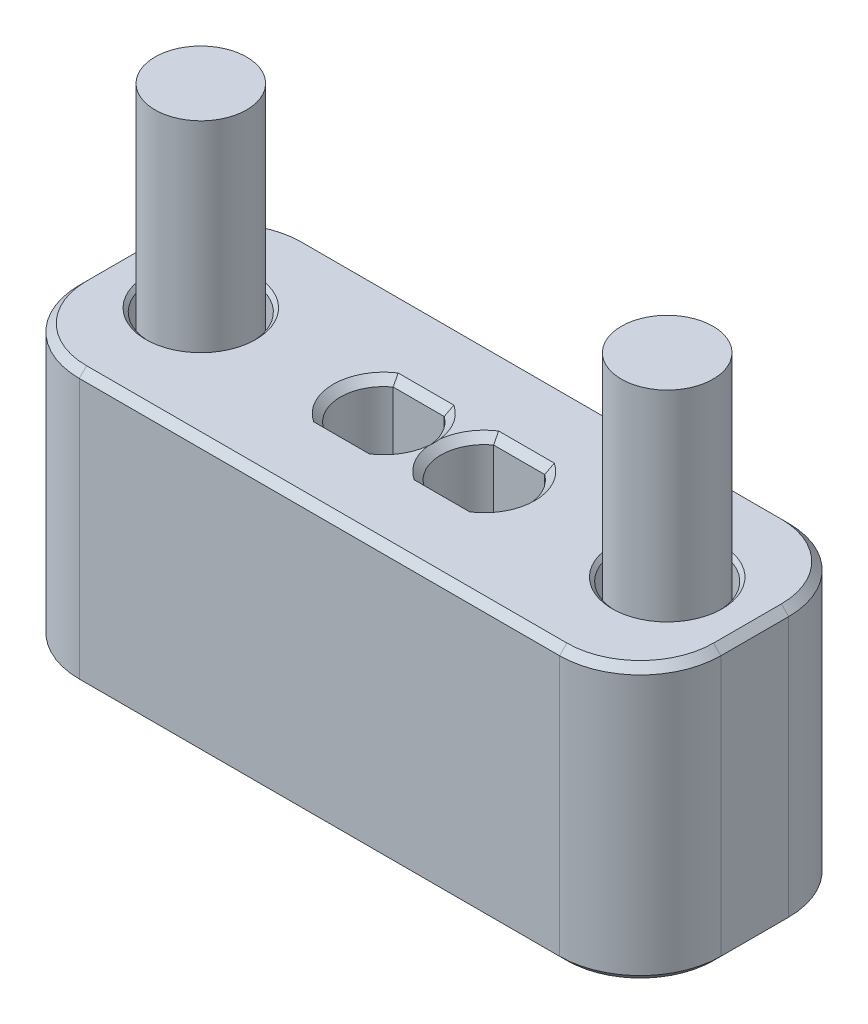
ISO-10303-21;
HEADER;
FILE_DESCRIPTION(('STEP AP214'),'2;1');
FILE_NAME('part.step','',(''),(''),'','','');
FILE_SCHEMA(('AUTOMOTIVE_DESIGN { 1 0 10303 214 1 1 1 1 }'));
ENDSEC;
DATA;
#1=APPLICATION_CONTEXT('core data for automotive mechanical design processes');
#2=APPLICATION_PROTOCOL_DEFINITION('international standard','automotive_design',2000,#1);
#3=PRODUCT_CONTEXT('',#1,'mechanical');
#4=PRODUCT('Part','Part','',(#3));
#5=PRODUCT_RELATED_PRODUCT_CATEGORY('part','',(#4));
#6=PRODUCT_DEFINITION_FORMATION('','',#4);
#7=PRODUCT_DEFINITION_CONTEXT('part definition',#1,'design');
#8=PRODUCT_DEFINITION('design','',#6,#7);
#9=PRODUCT_DEFINITION_SHAPE('','',#8);
#10=(LENGTH_UNIT() NAMED_UNIT(*) SI_UNIT(.MILLI.,.METRE.));
#11=(NAMED_UNIT(*) PLANE_ANGLE_UNIT() SI_UNIT($,.RADIAN.));
#12=(NAMED_UNIT(*) SI_UNIT($,.STERADIAN.) SOLID_ANGLE_UNIT());
#13=UNCERTAINTY_MEASURE_WITH_UNIT(LENGTH_MEASURE(1.E-05),#10,'distance_accuracy_value','');
#14=(GEOMETRIC_REPRESENTATION_CONTEXT(3) GLOBAL_UNCERTAINTY_ASSIGNED_CONTEXT((#13)) GLOBAL_UNIT_ASSIGNED_CONTEXT((#10,
#11,#12)) REPRESENTATION_CONTEXT('',''));
#15=CARTESIAN_POINT('',(0.,0.,0.));
#16=DIRECTION('',(0.,0.,1.));
#17=DIRECTION('',(1.,0.,0.));
#18=AXIS2_PLACEMENT_3D('',#15,#16,#17);
#19=CARTESIAN_POINT('',(16.1544,0.762000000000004,4.7625));
#20=DIRECTION('',(0.,-1.,0.));
#21=DIRECTION('',(1.,0.,0.));
#22=AXIS2_PLACEMENT_3D('',#19,#20,#21);
#23=PLANE('',#22);
#24=DIRECTION('',(-0.866025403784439,0.,0.5));
#25=VECTOR('',#24,1.);
#26=CARTESIAN_POINT('',(16.1544,0.762000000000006,-2.7569630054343));
#27=LINE('',#26,#25);
#28=CARTESIAN_POINT('',(16.1544,0.762000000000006,-2.7569630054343));
#29=VERTEX_POINT('',#28);
#30=CARTESIAN_POINT('',(13.7668,0.762000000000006,-1.37848150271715));
#31=VERTEX_POINT('',#30);
#32=EDGE_CURVE('E174',#29,#31,#27,.T.);
#33=ORIENTED_EDGE('',*,*,#32,.T.);
#34=DIRECTION('',(0.,0.,1.));
#35=VECTOR('',#34,1.);
#36=CARTESIAN_POINT('',(13.7668,0.762000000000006,-1.37848150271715));
#37=LINE('',#36,#35);
#38=CARTESIAN_POINT('',(13.7668,0.762000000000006,1.37848150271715));
#39=VERTEX_POINT('',#38);
#40=EDGE_CURVE('E177',#31,#39,#37,.T.);
#41=ORIENTED_EDGE('',*,*,#40,.T.);
#42=DIRECTION('',(0.866025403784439,0.,0.5));
#43=VECTOR('',#42,1.);
#44=CARTESIAN_POINT('',(13.7668,0.762000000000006,1.37848150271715));
#45=LINE('',#44,#43);
#46=CARTESIAN_POINT('',(16.1544,0.762000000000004,2.7569630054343));
#47=VERTEX_POINT('',#46);
#48=EDGE_CURVE('E180',#39,#47,#45,.T.);
#49=ORIENTED_EDGE('',*,*,#48,.T.);
#50=DIRECTION('',(0.866025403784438,0.,-0.5));
#51=VECTOR('',#50,1.);
#52=CARTESIAN_POINT('',(16.1544,0.762000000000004,2.7569630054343));
#53=LINE('',#52,#51);
#54=CARTESIAN_POINT('',(18.542,0.762000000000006,1.37848150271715));
#55=VERTEX_POINT('',#54);
#56=EDGE_CURVE('E185',#47,#55,#53,.T.);
#57=ORIENTED_EDGE('',*,*,#56,.T.);
#58=DIRECTION('',(0.,0.,-1.));
#59=VECTOR('',#58,1.);
#60=CARTESIAN_POINT('',(18.542,0.762000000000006,1.37848150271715));
#61=LINE('',#60,#59);
#62=CARTESIAN_POINT('',(18.542,0.762000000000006,-1.37848150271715));
#63=VERTEX_POINT('',#62);
#64=EDGE_CURVE('E123',#55,#63,#61,.T.);
#65=ORIENTED_EDGE('',*,*,#64,.T.);
#66=DIRECTION('',(-0.866025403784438,0.,-0.5));
#67=VECTOR('',#66,1.);
#68=CARTESIAN_POINT('',(18.542,0.762000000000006,-1.37848150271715));
#69=LINE('',#68,#67);
#70=EDGE_CURVE('E178',#63,#29,#69,.T.);
#71=ORIENTED_EDGE('',*,*,#70,.T.);
#72=EDGE_LOOP('',(#33,#41,#49,#57,#65,#71));
#73=FACE_BOUND('',#72,.T.);
#74=CARTESIAN_POINT('',(16.1544,0.762000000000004,0.));
#75=DIRECTION('',(0.,-1.,0.));
#76=DIRECTION('',(-1.,0.,0.));
#77=AXIS2_PLACEMENT_3D('',#74,#75,#76);
#78=CIRCLE('',#77,4.7625);
#79=CARTESIAN_POINT('',(11.3919,0.762000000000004,0.));
#80=VERTEX_POINT('',#79);
#81=EDGE_CURVE('E12',#80,#80,#78,.T.);
#82=ORIENTED_EDGE('',*,*,#81,.T.);
#83=EDGE_LOOP('',(#82));
#84=FACE_BOUND('',#83,.T.);
#85=ADVANCED_FACE('F45',(#73,#84),#23,.T.);
#86=CARTESIAN_POINT('',(16.1544,32.512,0.));
#87=DIRECTION('',(0.,1.,0.));
#88=DIRECTION('',(-1.,0.,0.));
#89=AXIS2_PLACEMENT_3D('',#86,#87,#88);
#90=CYLINDRICAL_SURFACE('',#89,4.7625);
#91=ORIENTED_EDGE('',*,*,#81,.F.);
#92=EDGE_LOOP('',(#91));
#93=FACE_BOUND('',#92,.T.);
#94=CARTESIAN_POINT('',(16.1544,7.112,0.));
#95=DIRECTION('',(0.,-1.,0.));
#96=DIRECTION('',(-1.,0.,0.));
#97=AXIS2_PLACEMENT_3D('',#94,#95,#96);
#98=CIRCLE('',#97,4.7625);
#99=CARTESIAN_POINT('',(11.3919,7.112,0.));
#100=VERTEX_POINT('',#99);
#101=EDGE_CURVE('E52',#100,#100,#98,.T.);
#102=ORIENTED_EDGE('',*,*,#101,.T.);
#103=EDGE_LOOP('',(#102));
#104=FACE_BOUND('',#103,.T.);
#105=ADVANCED_FACE('F142',(#93,#104),#90,.T.);
#106=CARTESIAN_POINT('',(16.1544,7.112,3.175));
#107=DIRECTION('',(0.,1.,0.));
#108=DIRECTION('',(-1.,0.,0.));
#109=AXIS2_PLACEMENT_3D('',#106,#107,#108);
#110=PLANE('',#109);
#111=ORIENTED_EDGE('',*,*,#101,.F.);
#112=EDGE_LOOP('',(#111));
#113=FACE_BOUND('',#112,.T.);
#114=CARTESIAN_POINT('',(16.1544,7.112,0.));
#115=DIRECTION('',(0.,-1.,0.));
#116=DIRECTION('',(-1.,0.,0.));
#117=AXIS2_PLACEMENT_3D('',#114,#115,#116);
#118=CIRCLE('',#117,3.175);
#119=CARTESIAN_POINT('',(12.9794,7.112,0.));
#120=VERTEX_POINT('',#119);
#121=EDGE_CURVE('E137',#120,#120,#118,.T.);
#122=ORIENTED_EDGE('',*,*,#121,.T.);
#123=EDGE_LOOP('',(#122));
#124=FACE_BOUND('',#123,.T.);
#125=ADVANCED_FACE('F144',(#113,#124),#110,.T.);
#126=CARTESIAN_POINT('',(16.1544,32.512,0.));
#127=DIRECTION('',(0.,1.,0.));
#128=DIRECTION('',(-1.,0.,0.));
#129=AXIS2_PLACEMENT_3D('',#126,#127,#128);
#130=CYLINDRICAL_SURFACE('',#129,3.175);
#131=ORIENTED_EDGE('',*,*,#121,.F.);
#132=EDGE_LOOP('',(#131));
#133=FACE_BOUND('',#132,.T.);
#134=CARTESIAN_POINT('',(16.1544,32.512,0.));
#135=DIRECTION('',(0.,-1.,0.));
#136=DIRECTION('',(-1.,0.,0.));
#137=AXIS2_PLACEMENT_3D('',#134,#135,#136);
#138=CIRCLE('',#137,3.175);
#139=CARTESIAN_POINT('',(12.9794,32.512,0.));
#140=VERTEX_POINT('',#139);
#141=EDGE_CURVE('E134',#140,#140,#138,.T.);
#142=ORIENTED_EDGE('',*,*,#141,.T.);
#143=EDGE_LOOP('',(#142));
#144=FACE_BOUND('',#143,.T.);
#145=ADVANCED_FACE('F147',(#133,#144),#130,.T.);
#146=CARTESIAN_POINT('',(16.1544,32.512,0.));
#147=DIRECTION('',(0.,1.,0.));
#148=DIRECTION('',(-1.,0.,0.));
#149=AXIS2_PLACEMENT_3D('',#146,#147,#148);
#150=PLANE('',#149);
#151=ORIENTED_EDGE('',*,*,#141,.F.);
#152=EDGE_LOOP('',(#151));
#153=FACE_BOUND('',#152,.T.);
#154=ADVANCED_FACE('F153',(#153),#150,.T.);
#155=CARTESIAN_POINT('',(16.1544,4.31800000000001,-2.7569630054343));
#156=DIRECTION('',(-0.5,0.,-0.866025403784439));
#157=DIRECTION('',(0.866025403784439,0.,-0.5));
#158=AXIS2_PLACEMENT_3D('',#155,#156,#157);
#159=PLANE('',#158);
#160=ORIENTED_EDGE('',*,*,#32,.F.);
#161=DIRECTION('',(0.,-1.,0.));
#162=VECTOR('',#161,1.);
#163=CARTESIAN_POINT('',(16.1544,4.31800000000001,-2.7569630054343));
#164=LINE('',#163,#162);
#165=CARTESIAN_POINT('',(16.1544,4.31800000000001,-2.7569630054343));
#166=VERTEX_POINT('',#165);
#167=EDGE_CURVE('E90',#166,#29,#164,.T.);
#168=ORIENTED_EDGE('',*,*,#167,.F.);
#169=DIRECTION('',(-0.866025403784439,0.,0.5));
#170=VECTOR('',#169,1.);
#171=CARTESIAN_POINT('',(16.1544,4.31800000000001,-2.7569630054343));
#172=LINE('',#171,#170);
#173=CARTESIAN_POINT('',(13.7668,4.31800000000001,-1.37848150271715));
#174=VERTEX_POINT('',#173);
#175=EDGE_CURVE('E188',#166,#174,#172,.T.);
#176=ORIENTED_EDGE('',*,*,#175,.T.);
#177=DIRECTION('',(0.,-1.,0.));
#178=VECTOR('',#177,1.);
#179=CARTESIAN_POINT('',(13.7668,4.31800000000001,-1.37848150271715));
#180=LINE('',#179,#178);
#181=EDGE_CURVE('E59',#174,#31,#180,.T.);
#182=ORIENTED_EDGE('',*,*,#181,.T.);
#183=EDGE_LOOP('',(#160,#168,#176,#182));
#184=FACE_BOUND('',#183,.T.);
#185=ADVANCED_FACE('F158',(#184),#159,.F.);
#186=CARTESIAN_POINT('',(18.542,4.31800000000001,-1.37848150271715));
#187=DIRECTION('',(0.5,0.,-0.866025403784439));
#188=DIRECTION('',(0.866025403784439,0.,0.5));
#189=AXIS2_PLACEMENT_3D('',#186,#187,#188);
#190=PLANE('',#189);
#191=ORIENTED_EDGE('',*,*,#70,.F.);
#192=DIRECTION('',(0.,-1.,0.));
#193=VECTOR('',#192,1.);
#194=CARTESIAN_POINT('',(18.542,4.31800000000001,-1.37848150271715));
#195=LINE('',#194,#193);
#196=CARTESIAN_POINT('',(18.542,4.31800000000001,-1.37848150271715));
#197=VERTEX_POINT('',#196);
#198=EDGE_CURVE('E125',#197,#63,#195,.T.);
#199=ORIENTED_EDGE('',*,*,#198,.F.);
#200=DIRECTION('',(-0.866025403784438,0.,-0.5));
#201=VECTOR('',#200,1.);
#202=CARTESIAN_POINT('',(18.542,4.31800000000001,-1.37848150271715));
#203=LINE('',#202,#201);
#204=EDGE_CURVE('E68',#197,#166,#203,.T.);
#205=ORIENTED_EDGE('',*,*,#204,.T.);
#206=ORIENTED_EDGE('',*,*,#167,.T.);
#207=EDGE_LOOP('',(#191,#199,#205,#206));
#208=FACE_BOUND('',#207,.T.);
#209=ADVANCED_FACE('F163',(#208),#190,.F.);
#210=CARTESIAN_POINT('',(18.542,4.31800000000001,1.37848150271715));
#211=DIRECTION('',(1.,0.,0.));
#212=DIRECTION('',(0.,1.,0.));
#213=AXIS2_PLACEMENT_3D('',#210,#211,#212);
#214=PLANE('',#213);
#215=ORIENTED_EDGE('',*,*,#64,.F.);
#216=DIRECTION('',(0.,-1.,0.));
#217=VECTOR('',#216,1.);
#218=CARTESIAN_POINT('',(18.542,4.31800000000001,1.37848150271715));
#219=LINE('',#218,#217);
#220=CARTESIAN_POINT('',(18.542,4.31800000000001,1.37848150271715));
#221=VERTEX_POINT('',#220);
#222=EDGE_CURVE('E112',#221,#55,#219,.T.);
#223=ORIENTED_EDGE('',*,*,#222,.F.);
#224=DIRECTION('',(0.,0.,-1.));
#225=VECTOR('',#224,1.);
#226=CARTESIAN_POINT('',(18.542,4.31800000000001,1.37848150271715));
#227=LINE('',#226,#225);
#228=EDGE_CURVE('E115',#221,#197,#227,.T.);
#229=ORIENTED_EDGE('',*,*,#228,.T.);
#230=ORIENTED_EDGE('',*,*,#198,.T.);
#231=EDGE_LOOP('',(#215,#223,#229,#230));
#232=FACE_BOUND('',#231,.T.);
#233=ADVANCED_FACE('F121',(#232),#214,.F.);
#234=CARTESIAN_POINT('',(16.1544,4.31800000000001,2.7569630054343));
#235=DIRECTION('',(0.5,0.,0.866025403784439));
#236=DIRECTION('',(-0.866025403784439,0.,0.5));
#237=AXIS2_PLACEMENT_3D('',#234,#235,#236);
#238=PLANE('',#237);
#239=ORIENTED_EDGE('',*,*,#56,.F.);
#240=DIRECTION('',(0.,-1.,0.));
#241=VECTOR('',#240,1.);
#242=CARTESIAN_POINT('',(16.1544,4.31800000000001,2.7569630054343));
#243=LINE('',#242,#241);
#244=CARTESIAN_POINT('',(16.1544,4.31800000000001,2.7569630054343));
#245=VERTEX_POINT('',#244);
#246=EDGE_CURVE('E114',#245,#47,#243,.T.);
#247=ORIENTED_EDGE('',*,*,#246,.F.);
#248=DIRECTION('',(0.866025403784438,0.,-0.5));
#249=VECTOR('',#248,1.);
#250=CARTESIAN_POINT('',(16.1544,4.31800000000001,2.7569630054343));
#251=LINE('',#250,#249);
#252=EDGE_CURVE('E107',#245,#221,#251,.T.);
#253=ORIENTED_EDGE('',*,*,#252,.T.);
#254=ORIENTED_EDGE('',*,*,#222,.T.);
#255=EDGE_LOOP('',(#239,#247,#253,#254));
#256=FACE_BOUND('',#255,.T.);
#257=ADVANCED_FACE('F110',(#256),#238,.F.);
#258=CARTESIAN_POINT('',(13.7668,4.31800000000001,1.37848150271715));
#259=DIRECTION('',(-0.5,0.,0.866025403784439));
#260=DIRECTION('',(-0.866025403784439,0.,-0.5));
#261=AXIS2_PLACEMENT_3D('',#258,#259,#260);
#262=PLANE('',#261);
#263=ORIENTED_EDGE('',*,*,#48,.F.);
#264=DIRECTION('',(0.,-1.,0.));
#265=VECTOR('',#264,1.);
#266=CARTESIAN_POINT('',(13.7668,4.31800000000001,1.37848150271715));
#267=LINE('',#266,#265);
#268=CARTESIAN_POINT('',(13.7668,4.31800000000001,1.37848150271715));
#269=VERTEX_POINT('',#268);
#270=EDGE_CURVE('E128',#269,#39,#267,.T.);
#271=ORIENTED_EDGE('',*,*,#270,.F.);
#272=DIRECTION('',(0.866025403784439,0.,0.5));
#273=VECTOR('',#272,1.);
#274=CARTESIAN_POINT('',(13.7668,4.31800000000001,1.37848150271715));
#275=LINE('',#274,#273);
#276=EDGE_CURVE('E116',#269,#245,#275,.T.);
#277=ORIENTED_EDGE('',*,*,#276,.T.);
#278=ORIENTED_EDGE('',*,*,#246,.T.);
#279=EDGE_LOOP('',(#263,#271,#277,#278));
#280=FACE_BOUND('',#279,.T.);
#281=ADVANCED_FACE('F195',(#280),#262,.F.);
#282=CARTESIAN_POINT('',(13.7668,4.31800000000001,-1.37848150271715));
#283=DIRECTION('',(-1.,0.,0.));
#284=DIRECTION('',(0.,-1.,0.));
#285=AXIS2_PLACEMENT_3D('',#282,#283,#284);
#286=PLANE('',#285);
#287=ORIENTED_EDGE('',*,*,#40,.F.);
#288=ORIENTED_EDGE('',*,*,#181,.F.);
#289=DIRECTION('',(0.,0.,1.));
#290=VECTOR('',#289,1.);
#291=CARTESIAN_POINT('',(13.7668,4.31800000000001,-1.37848150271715));
#292=LINE('',#291,#290);
#293=EDGE_CURVE('E98',#174,#269,#292,.T.);
#294=ORIENTED_EDGE('',*,*,#293,.T.);
#295=ORIENTED_EDGE('',*,*,#270,.T.);
#296=EDGE_LOOP('',(#287,#288,#294,#295));
#297=FACE_BOUND('',#296,.T.);
#298=ADVANCED_FACE('F197',(#297),#286,.F.);
#299=CARTESIAN_POINT('',(16.1544,4.31800000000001,-2.7569630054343));
#300=DIRECTION('',(0.,1.,0.));
#301=DIRECTION('',(-1.,0.,0.));
#302=AXIS2_PLACEMENT_3D('',#299,#300,#301);
#303=PLANE('',#302);
#304=ORIENTED_EDGE('',*,*,#175,.F.);
#305=ORIENTED_EDGE('',*,*,#204,.F.);
#306=ORIENTED_EDGE('',*,*,#228,.F.);
#307=ORIENTED_EDGE('',*,*,#252,.F.);
#308=ORIENTED_EDGE('',*,*,#276,.F.);
#309=ORIENTED_EDGE('',*,*,#293,.F.);
#310=EDGE_LOOP('',(#304,#305,#306,#307,#308,#309));
#311=FACE_BOUND('',#310,.T.);
#312=ADVANCED_FACE('F118',(#311),#303,.F.);
#313=CLOSED_SHELL('',(#85,#105,#125,#145,#154,#185,#209,#233,#257,#281,#298,#312));
#314=MANIFOLD_SOLID_BREP('B2',#313);
#315=CARTESIAN_POINT('',(-16.1544,0.762000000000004,4.7625));
#316=DIRECTION('',(0.,-1.,0.));
#317=DIRECTION('',(-1.,0.,0.));
#318=AXIS2_PLACEMENT_3D('',#315,#316,#317);
#319=PLANE('',#318);
#320=DIRECTION('',(0.866025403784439,0.,0.5));
#321=VECTOR('',#320,1.);
#322=CARTESIAN_POINT('',(-16.1544,0.762000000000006,-2.7569630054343));
#323=LINE('',#322,#321);
#324=CARTESIAN_POINT('',(-16.1544,0.762000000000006,-2.7569630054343));
#325=VERTEX_POINT('',#324);
#326=CARTESIAN_POINT('',(-13.7668,0.762000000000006,-1.37848150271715));
#327=VERTEX_POINT('',#326);
#328=EDGE_CURVE('E304',#325,#327,#323,.T.);
#329=ORIENTED_EDGE('',*,*,#328,.F.);
#330=DIRECTION('',(0.866025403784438,0.,-0.5));
#331=VECTOR('',#330,1.);
#332=CARTESIAN_POINT('',(-18.542,0.762000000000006,-1.37848150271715));
#333=LINE('',#332,#331);
#334=CARTESIAN_POINT('',(-18.542,0.762000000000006,-1.37848150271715));
#335=VERTEX_POINT('',#334);
#336=EDGE_CURVE('E387',#335,#325,#333,.T.);
#337=ORIENTED_EDGE('',*,*,#336,.F.);
#338=DIRECTION('',(0.,0.,-1.));
#339=VECTOR('',#338,1.);
#340=CARTESIAN_POINT('',(-18.542,0.762000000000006,1.37848150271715));
#341=LINE('',#340,#339);
#342=CARTESIAN_POINT('',(-18.542,0.762000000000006,1.37848150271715));
#343=VERTEX_POINT('',#342);
#344=EDGE_CURVE('E385',#343,#335,#341,.T.);
#345=ORIENTED_EDGE('',*,*,#344,.F.);
#346=DIRECTION('',(-0.866025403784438,0.,-0.5));
#347=VECTOR('',#346,1.);
#348=CARTESIAN_POINT('',(-16.1544,0.762000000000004,2.7569630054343));
#349=LINE('',#348,#347);
#350=CARTESIAN_POINT('',(-16.1544,0.762000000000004,2.7569630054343));
#351=VERTEX_POINT('',#350);
#352=EDGE_CURVE('E352',#351,#343,#349,.T.);
#353=ORIENTED_EDGE('',*,*,#352,.F.);
#354=DIRECTION('',(-0.866025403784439,0.,0.5));
#355=VECTOR('',#354,1.);
#356=CARTESIAN_POINT('',(-13.7668,0.762000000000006,1.37848150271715));
#357=LINE('',#356,#355);
#358=CARTESIAN_POINT('',(-13.7668,0.762000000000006,1.37848150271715));
#359=VERTEX_POINT('',#358);
#360=EDGE_CURVE('E381',#359,#351,#357,.T.);
#361=ORIENTED_EDGE('',*,*,#360,.F.);
#362=DIRECTION('',(0.,0.,1.));
#363=VECTOR('',#362,1.);
#364=CARTESIAN_POINT('',(-13.7668,0.762000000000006,-1.37848150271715));
#365=LINE('',#364,#363);
#366=EDGE_CURVE('E378',#327,#359,#365,.T.);
#367=ORIENTED_EDGE('',*,*,#366,.F.);
#368=EDGE_LOOP('',(#329,#337,#345,#353,#361,#367));
#369=FACE_BOUND('',#368,.T.);
#370=CARTESIAN_POINT('',(-16.1544,0.762000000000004,0.));
#371=DIRECTION('',(0.,1.,0.));
#372=DIRECTION('',(1.,0.,0.));
#373=AXIS2_PLACEMENT_3D('',#370,#371,#372);
#374=CIRCLE('',#373,4.7625);
#375=CARTESIAN_POINT('',(-11.3919,0.762000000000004,0.));
#376=VERTEX_POINT('',#375);
#377=EDGE_CURVE('E43',#376,#376,#374,.T.);
#378=ORIENTED_EDGE('',*,*,#377,.F.);
#379=EDGE_LOOP('',(#378));
#380=FACE_BOUND('',#379,.T.);
#381=ADVANCED_FACE('F290',(#369,#380),#319,.T.);
#382=CARTESIAN_POINT('',(-16.1544,32.512,0.));
#383=DIRECTION('',(0.,1.,0.));
#384=DIRECTION('',(1.,0.,0.));
#385=AXIS2_PLACEMENT_3D('',#382,#383,#384);
#386=CYLINDRICAL_SURFACE('',#385,4.7625);
#387=ORIENTED_EDGE('',*,*,#377,.T.);
#388=EDGE_LOOP('',(#387));
#389=FACE_BOUND('',#388,.T.);
#390=CARTESIAN_POINT('',(-16.1544,7.112,0.));
#391=DIRECTION('',(0.,1.,0.));
#392=DIRECTION('',(1.,0.,0.));
#393=AXIS2_PLACEMENT_3D('',#390,#391,#392);
#394=CIRCLE('',#393,4.7625);
#395=CARTESIAN_POINT('',(-11.3919,7.112,0.));
#396=VERTEX_POINT('',#395);
#397=EDGE_CURVE('E297',#396,#396,#394,.T.);
#398=ORIENTED_EDGE('',*,*,#397,.F.);
#399=EDGE_LOOP('',(#398));
#400=FACE_BOUND('',#399,.T.);
#401=ADVANCED_FACE('F407',(#389,#400),#386,.T.);
#402=CARTESIAN_POINT('',(-16.1544,7.112,3.175));
#403=DIRECTION('',(0.,1.,0.));
#404=DIRECTION('',(1.,0.,0.));
#405=AXIS2_PLACEMENT_3D('',#402,#403,#404);
#406=PLANE('',#405);
#407=ORIENTED_EDGE('',*,*,#397,.T.);
#408=EDGE_LOOP('',(#407));
#409=FACE_BOUND('',#408,.T.);
#410=CARTESIAN_POINT('',(-16.1544,7.112,0.));
#411=DIRECTION('',(0.,1.,0.));
#412=DIRECTION('',(1.,0.,0.));
#413=AXIS2_PLACEMENT_3D('',#410,#411,#412);
#414=CIRCLE('',#413,3.175);
#415=CARTESIAN_POINT('',(-12.9794,7.112,0.));
#416=VERTEX_POINT('',#415);
#417=EDGE_CURVE('E399',#416,#416,#414,.T.);
#418=ORIENTED_EDGE('',*,*,#417,.F.);
#419=EDGE_LOOP('',(#418));
#420=FACE_BOUND('',#419,.T.);
#421=ADVANCED_FACE('F404',(#409,#420),#406,.T.);
#422=CARTESIAN_POINT('',(-16.1544,32.512,0.));
#423=DIRECTION('',(0.,1.,0.));
#424=DIRECTION('',(1.,0.,0.));
#425=AXIS2_PLACEMENT_3D('',#422,#423,#424);
#426=CYLINDRICAL_SURFACE('',#425,3.175);
#427=ORIENTED_EDGE('',*,*,#417,.T.);
#428=EDGE_LOOP('',(#427));
#429=FACE_BOUND('',#428,.T.);
#430=CARTESIAN_POINT('',(-16.1544,32.512,0.));
#431=DIRECTION('',(0.,1.,0.));
#432=DIRECTION('',(1.,0.,0.));
#433=AXIS2_PLACEMENT_3D('',#430,#431,#432);
#434=CIRCLE('',#433,3.175);
#435=CARTESIAN_POINT('',(-12.9794,32.512,0.));
#436=VERTEX_POINT('',#435);
#437=EDGE_CURVE('E391',#436,#436,#434,.T.);
#438=ORIENTED_EDGE('',*,*,#437,.F.);
#439=EDGE_LOOP('',(#438));
#440=FACE_BOUND('',#439,.T.);
#441=ADVANCED_FACE('F414',(#429,#440),#426,.T.);
#442=CARTESIAN_POINT('',(-16.1544,32.512,0.));
#443=DIRECTION('',(0.,1.,0.));
#444=DIRECTION('',(1.,0.,0.));
#445=AXIS2_PLACEMENT_3D('',#442,#443,#444);
#446=PLANE('',#445);
#447=ORIENTED_EDGE('',*,*,#437,.T.);
#448=EDGE_LOOP('',(#447));
#449=FACE_BOUND('',#448,.T.);
#450=ADVANCED_FACE('F420',(#449),#446,.T.);
#451=CARTESIAN_POINT('',(-16.1544,4.31800000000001,-2.7569630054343));
#452=DIRECTION('',(0.5,0.,-0.866025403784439));
#453=DIRECTION('',(-0.866025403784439,0.,-0.5));
#454=AXIS2_PLACEMENT_3D('',#451,#452,#453);
#455=PLANE('',#454);
#456=ORIENTED_EDGE('',*,*,#328,.T.);
#457=DIRECTION('',(0.,-1.,0.));
#458=VECTOR('',#457,1.);
#459=CARTESIAN_POINT('',(-13.7668,4.31800000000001,-1.37848150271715));
#460=LINE('',#459,#458);
#461=CARTESIAN_POINT('',(-13.7668,4.31800000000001,-1.37848150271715));
#462=VERTEX_POINT('',#461);
#463=EDGE_CURVE('E334',#462,#327,#460,.T.);
#464=ORIENTED_EDGE('',*,*,#463,.F.);
#465=DIRECTION('',(0.866025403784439,0.,0.5));
#466=VECTOR('',#465,1.);
#467=CARTESIAN_POINT('',(-16.1544,4.31800000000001,-2.7569630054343));
#468=LINE('',#467,#466);
#469=CARTESIAN_POINT('',(-16.1544,4.31800000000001,-2.7569630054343));
#470=VERTEX_POINT('',#469);
#471=EDGE_CURVE('E389',#470,#462,#468,.T.);
#472=ORIENTED_EDGE('',*,*,#471,.F.);
#473=DIRECTION('',(0.,-1.,0.));
#474=VECTOR('',#473,1.);
#475=CARTESIAN_POINT('',(-16.1544,4.31800000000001,-2.7569630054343));
#476=LINE('',#475,#474);
#477=EDGE_CURVE('E312',#470,#325,#476,.T.);
#478=ORIENTED_EDGE('',*,*,#477,.T.);
#479=EDGE_LOOP('',(#456,#464,#472,#478));
#480=FACE_BOUND('',#479,.T.);
#481=ADVANCED_FACE('F424',(#480),#455,.F.);
#482=CARTESIAN_POINT('',(-18.542,4.31800000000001,-1.37848150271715));
#483=DIRECTION('',(-0.5,0.,-0.866025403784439));
#484=DIRECTION('',(-0.866025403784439,0.,0.5));
#485=AXIS2_PLACEMENT_3D('',#482,#483,#484);
#486=PLANE('',#485);
#487=ORIENTED_EDGE('',*,*,#336,.T.);
#488=ORIENTED_EDGE('',*,*,#477,.F.);
#489=DIRECTION('',(0.866025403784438,0.,-0.5));
#490=VECTOR('',#489,1.);
#491=CARTESIAN_POINT('',(-18.542,4.31800000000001,-1.37848150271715));
#492=LINE('',#491,#490);
#493=CARTESIAN_POINT('',(-18.542,4.31800000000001,-1.37848150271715));
#494=VERTEX_POINT('',#493);
#495=EDGE_CURVE('E364',#494,#470,#492,.T.);
#496=ORIENTED_EDGE('',*,*,#495,.F.);
#497=DIRECTION('',(0.,-1.,0.));
#498=VECTOR('',#497,1.);
#499=CARTESIAN_POINT('',(-18.542,4.31800000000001,-1.37848150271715));
#500=LINE('',#499,#498);
#501=EDGE_CURVE('E356',#494,#335,#500,.T.);
#502=ORIENTED_EDGE('',*,*,#501,.T.);
#503=EDGE_LOOP('',(#487,#488,#496,#502));
#504=FACE_BOUND('',#503,.T.);
#505=ADVANCED_FACE('F428',(#504),#486,.F.);
#506=CARTESIAN_POINT('',(-18.542,4.31800000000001,1.37848150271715));
#507=DIRECTION('',(-1.,0.,0.));
#508=DIRECTION('',(0.,1.,0.));
#509=AXIS2_PLACEMENT_3D('',#506,#507,#508);
#510=PLANE('',#509);
#511=ORIENTED_EDGE('',*,*,#344,.T.);
#512=ORIENTED_EDGE('',*,*,#501,.F.);
#513=DIRECTION('',(0.,0.,-1.));
#514=VECTOR('',#513,1.);
#515=CARTESIAN_POINT('',(-18.542,4.31800000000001,1.37848150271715));
#516=LINE('',#515,#514);
#517=CARTESIAN_POINT('',(-18.542,4.31800000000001,1.37848150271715));
#518=VERTEX_POINT('',#517);
#519=EDGE_CURVE('E360',#518,#494,#516,.T.);
#520=ORIENTED_EDGE('',*,*,#519,.F.);
#521=DIRECTION('',(0.,-1.,0.));
#522=VECTOR('',#521,1.);
#523=CARTESIAN_POINT('',(-18.542,4.31800000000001,1.37848150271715));
#524=LINE('',#523,#522);
#525=EDGE_CURVE('E345',#518,#343,#524,.T.);
#526=ORIENTED_EDGE('',*,*,#525,.T.);
#527=EDGE_LOOP('',(#511,#512,#520,#526));
#528=FACE_BOUND('',#527,.T.);
#529=ADVANCED_FACE('F361',(#528),#510,.F.);
#530=CARTESIAN_POINT('',(-16.1544,4.31800000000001,2.7569630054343));
#531=DIRECTION('',(-0.5,0.,0.866025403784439));
#532=DIRECTION('',(0.866025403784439,0.,0.5));
#533=AXIS2_PLACEMENT_3D('',#530,#531,#532);
#534=PLANE('',#533);
#535=ORIENTED_EDGE('',*,*,#352,.T.);
#536=ORIENTED_EDGE('',*,*,#525,.F.);
#537=DIRECTION('',(-0.866025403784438,0.,-0.5));
#538=VECTOR('',#537,1.);
#539=CARTESIAN_POINT('',(-16.1544,4.31800000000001,2.7569630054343));
#540=LINE('',#539,#538);
#541=CARTESIAN_POINT('',(-16.1544,4.31800000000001,2.7569630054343));
#542=VERTEX_POINT('',#541);
#543=EDGE_CURVE('E349',#542,#518,#540,.T.);
#544=ORIENTED_EDGE('',*,*,#543,.F.);
#545=DIRECTION('',(0.,-1.,0.));
#546=VECTOR('',#545,1.);
#547=CARTESIAN_POINT('',(-16.1544,4.31800000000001,2.7569630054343));
#548=LINE('',#547,#546);
#549=EDGE_CURVE('E357',#542,#351,#548,.T.);
#550=ORIENTED_EDGE('',*,*,#549,.T.);
#551=EDGE_LOOP('',(#535,#536,#544,#550));
#552=FACE_BOUND('',#551,.T.);
#553=ADVANCED_FACE('F347',(#552),#534,.F.);
#554=CARTESIAN_POINT('',(-13.7668,4.31800000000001,1.37848150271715));
#555=DIRECTION('',(0.5,0.,0.866025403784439));
#556=DIRECTION('',(0.866025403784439,0.,-0.5));
#557=AXIS2_PLACEMENT_3D('',#554,#555,#556);
#558=PLANE('',#557);
#559=ORIENTED_EDGE('',*,*,#360,.T.);
#560=ORIENTED_EDGE('',*,*,#549,.F.);
#561=DIRECTION('',(-0.866025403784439,0.,0.5));
#562=VECTOR('',#561,1.);
#563=CARTESIAN_POINT('',(-13.7668,4.31800000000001,1.37848150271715));
#564=LINE('',#563,#562);
#565=CARTESIAN_POINT('',(-13.7668,4.31800000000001,1.37848150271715));
#566=VERTEX_POINT('',#565);
#567=EDGE_CURVE('E370',#566,#542,#564,.T.);
#568=ORIENTED_EDGE('',*,*,#567,.F.);
#569=DIRECTION('',(0.,-1.,0.));
#570=VECTOR('',#569,1.);
#571=CARTESIAN_POINT('',(-13.7668,4.31800000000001,1.37848150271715));
#572=LINE('',#571,#570);
#573=EDGE_CURVE('E394',#566,#359,#572,.T.);
#574=ORIENTED_EDGE('',*,*,#573,.T.);
#575=EDGE_LOOP('',(#559,#560,#568,#574));
#576=FACE_BOUND('',#575,.T.);
#577=ADVANCED_FACE('F432',(#576),#558,.F.);
#578=CARTESIAN_POINT('',(-13.7668,4.31800000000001,-1.37848150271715));
#579=DIRECTION('',(1.,0.,0.));
#580=DIRECTION('',(0.,-1.,0.));
#581=AXIS2_PLACEMENT_3D('',#578,#579,#580);
#582=PLANE('',#581);
#583=ORIENTED_EDGE('',*,*,#366,.T.);
#584=ORIENTED_EDGE('',*,*,#573,.F.);
#585=DIRECTION('',(0.,0.,1.));
#586=VECTOR('',#585,1.);
#587=CARTESIAN_POINT('',(-13.7668,4.31800000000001,-1.37848150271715));
#588=LINE('',#587,#586);
#589=EDGE_CURVE('E372',#462,#566,#588,.T.);
#590=ORIENTED_EDGE('',*,*,#589,.F.);
#591=ORIENTED_EDGE('',*,*,#463,.T.);
#592=EDGE_LOOP('',(#583,#584,#590,#591));
#593=FACE_BOUND('',#592,.T.);
#594=ADVANCED_FACE('F429',(#593),#582,.F.);
#595=CARTESIAN_POINT('',(-16.1544,4.31800000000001,-2.7569630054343));
#596=DIRECTION('',(0.,1.,0.));
#597=DIRECTION('',(1.,0.,0.));
#598=AXIS2_PLACEMENT_3D('',#595,#596,#597);
#599=PLANE('',#598);
#600=ORIENTED_EDGE('',*,*,#471,.T.);
#601=ORIENTED_EDGE('',*,*,#589,.T.);
#602=ORIENTED_EDGE('',*,*,#567,.T.);
#603=ORIENTED_EDGE('',*,*,#543,.T.);
#604=ORIENTED_EDGE('',*,*,#519,.T.);
#605=ORIENTED_EDGE('',*,*,#495,.T.);
#606=EDGE_LOOP('',(#600,#601,#602,#603,#604,#605));
#607=FACE_BOUND('',#606,.T.);
#608=ADVANCED_FACE('F367',(#607),#599,.F.);
#609=CLOSED_SHELL('',(#381,#401,#421,#441,#450,#481,#505,#529,#553,#577,#594,#608));
#610=MANIFOLD_SOLID_BREP('B6',#609);
#611=CARTESIAN_POINT('',(22.225,19.05,-7.9375));
#612=DIRECTION('',(0.,-1.,0.));
#613=DIRECTION('',(0.,0.,-1.));
#614=AXIS2_PLACEMENT_3D('',#611,#612,#613);
#615=PLANE('',#614);
#616=CARTESIAN_POINT('',(-16.1544,19.05,0.));
#617=DIRECTION('',(0.,-1.,0.));
#618=DIRECTION('',(0.,0.,-1.));
#619=AXIS2_PLACEMENT_3D('',#616,#617,#618);
#620=CIRCLE('',#619,3.81);
#621=CARTESIAN_POINT('',(-16.1544,19.05,-3.81));
#622=VERTEX_POINT('',#621);
#623=EDGE_CURVE('E1358',#622,#622,#620,.T.);
#624=ORIENTED_EDGE('',*,*,#623,.T.);
#625=EDGE_LOOP('',(#624));
#626=FACE_BOUND('',#625,.T.);
#627=CARTESIAN_POINT('',(3.4798,19.05,0.));
#628=DIRECTION('',(0.,-1.,0.));
#629=DIRECTION('',(0.,0.,-1.));
#630=AXIS2_PLACEMENT_3D('',#627,#628,#629);
#631=CIRCLE('',#630,3.50520000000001);
#632=CARTESIAN_POINT('',(0.,19.05,-0.421211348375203));
#633=VERTEX_POINT('',#632);
#634=CARTESIAN_POINT('',(1.55183500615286,19.05,-2.92735000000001));
#635=VERTEX_POINT('',#634);
#636=EDGE_CURVE('E1253',#633,#635,#631,.T.);
#637=ORIENTED_EDGE('',*,*,#636,.T.);
#638=DIRECTION('',(1.,0.,0.));
#639=VECTOR('',#638,1.);
#640=CARTESIAN_POINT('',(22.225,19.05,-2.92735000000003));
#641=LINE('',#640,#639);
#642=CARTESIAN_POINT('',(5.40776499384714,19.05,-2.92735000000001));
#643=VERTEX_POINT('',#642);
#644=EDGE_CURVE('E1262',#635,#643,#641,.T.);
#645=ORIENTED_EDGE('',*,*,#644,.T.);
#646=CARTESIAN_POINT('',(3.4798,19.05,0.));
#647=DIRECTION('',(0.,-1.,0.));
#648=DIRECTION('',(0.,0.,-1.));
#649=AXIS2_PLACEMENT_3D('',#646,#647,#648);
#650=CIRCLE('',#649,3.50520000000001);
#651=CARTESIAN_POINT('',(5.40776499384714,19.05,2.92735000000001));
#652=VERTEX_POINT('',#651);
#653=EDGE_CURVE('E1259',#643,#652,#650,.T.);
#654=ORIENTED_EDGE('',*,*,#653,.T.);
#655=DIRECTION('',(-1.,0.,0.));
#656=VECTOR('',#655,1.);
#657=CARTESIAN_POINT('',(22.225,19.05,2.92735000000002));
#658=LINE('',#657,#656);
#659=CARTESIAN_POINT('',(1.55183500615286,19.05,2.92735000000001));
#660=VERTEX_POINT('',#659);
#661=EDGE_CURVE('E1257',#652,#660,#658,.T.);
#662=ORIENTED_EDGE('',*,*,#661,.T.);
#663=CARTESIAN_POINT('',(3.4798,19.05,0.));
#664=DIRECTION('',(0.,-1.,0.));
#665=DIRECTION('',(0.,0.,-1.));
#666=AXIS2_PLACEMENT_3D('',#663,#664,#665);
#667=CIRCLE('',#666,3.50520000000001);
#668=CARTESIAN_POINT('',(0.,19.05,0.421211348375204));
#669=VERTEX_POINT('',#668);
#670=EDGE_CURVE('E1255',#660,#669,#667,.T.);
#671=ORIENTED_EDGE('',*,*,#670,.T.);
#672=CARTESIAN_POINT('',(-3.4798,19.05,0.));
#673=DIRECTION('',(0.,-1.,0.));
#674=DIRECTION('',(0.,0.,-1.));
#675=AXIS2_PLACEMENT_3D('',#672,#673,#674);
#676=CIRCLE('',#675,3.50520000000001);
#677=CARTESIAN_POINT('',(-1.55183500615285,19.05,2.92735000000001));
#678=VERTEX_POINT('',#677);
#679=EDGE_CURVE('E1249',#669,#678,#676,.T.);
#680=ORIENTED_EDGE('',*,*,#679,.T.);
#681=DIRECTION('',(-1.,0.,0.));
#682=VECTOR('',#681,1.);
#683=CARTESIAN_POINT('',(22.225,19.05,2.92735));
#684=LINE('',#683,#682);
#685=CARTESIAN_POINT('',(-5.40776499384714,19.05,2.92735000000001));
#686=VERTEX_POINT('',#685);
#687=EDGE_CURVE('E1247',#678,#686,#684,.T.);
#688=ORIENTED_EDGE('',*,*,#687,.T.);
#689=CARTESIAN_POINT('',(-3.4798,19.05,0.));
#690=DIRECTION('',(0.,-1.,0.));
#691=DIRECTION('',(0.,0.,-1.));
#692=AXIS2_PLACEMENT_3D('',#689,#690,#691);
#693=CIRCLE('',#692,3.50520000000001);
#694=CARTESIAN_POINT('',(-5.40776499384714,19.05,-2.92735000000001));
#695=VERTEX_POINT('',#694);
#696=EDGE_CURVE('E1245',#686,#695,#693,.T.);
#697=ORIENTED_EDGE('',*,*,#696,.T.);
#698=DIRECTION('',(1.,0.,0.));
#699=VECTOR('',#698,1.);
#700=CARTESIAN_POINT('',(22.225,19.05,-2.92735));
#701=LINE('',#700,#699);
#702=CARTESIAN_POINT('',(-1.55183500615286,19.05,-2.92735000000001));
#703=VERTEX_POINT('',#702);
#704=EDGE_CURVE('E1243',#695,#703,#701,.T.);
#705=ORIENTED_EDGE('',*,*,#704,.T.);
#706=CARTESIAN_POINT('',(-3.4798,19.05,0.));
#707=DIRECTION('',(0.,-1.,0.));
#708=DIRECTION('',(0.,0.,-1.));
#709=AXIS2_PLACEMENT_3D('',#706,#707,#708);
#710=CIRCLE('',#709,3.50520000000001);
#711=EDGE_CURVE('E1251',#703,#633,#710,.T.);
#712=ORIENTED_EDGE('',*,*,#711,.T.);
#713=EDGE_LOOP('',(#637,#645,#654,#662,#671,#680,#688,#697,#705,#712));
#714=FACE_BOUND('',#713,.T.);
#715=CARTESIAN_POINT('',(16.637,19.05,-2.3495));
#716=DIRECTION('',(0.,-1.,0.));
#717=DIRECTION('',(0.,0.,-1.));
#718=AXIS2_PLACEMENT_3D('',#715,#716,#717);
#719=CIRCLE('',#718,5.08);
#720=CARTESIAN_POINT('',(21.717,19.05,-2.3495));
#721=VERTEX_POINT('',#720);
#722=CARTESIAN_POINT('',(16.637,19.05,-7.4295));
#723=VERTEX_POINT('',#722);
#724=EDGE_CURVE('E1166',#721,#723,#719,.F.);
#725=ORIENTED_EDGE('',*,*,#724,.T.);
#726=DIRECTION('',(-1.,0.,0.));
#727=VECTOR('',#726,1.);
#728=CARTESIAN_POINT('',(22.225,19.05,-7.4295));
#729=LINE('',#728,#727);
#730=CARTESIAN_POINT('',(-16.637,19.05,-7.4295));
#731=VERTEX_POINT('',#730);
#732=EDGE_CURVE('E514',#723,#731,#729,.T.);
#733=ORIENTED_EDGE('',*,*,#732,.T.);
#734=CARTESIAN_POINT('',(-16.637,19.05,-2.3495));
#735=DIRECTION('',(0.,-1.,0.));
#736=DIRECTION('',(0.,0.,-1.));
#737=AXIS2_PLACEMENT_3D('',#734,#735,#736);
#738=CIRCLE('',#737,5.08);
#739=CARTESIAN_POINT('',(-21.717,19.05,-2.3495));
#740=VERTEX_POINT('',#739);
#741=EDGE_CURVE('E1167',#731,#740,#738,.F.);
#742=ORIENTED_EDGE('',*,*,#741,.T.);
#743=DIRECTION('',(0.,0.,1.));
#744=VECTOR('',#743,1.);
#745=CARTESIAN_POINT('',(-21.717,19.05,-7.9375));
#746=LINE('',#745,#744);
#747=CARTESIAN_POINT('',(-21.717,19.05,2.3495));
#748=VERTEX_POINT('',#747);
#749=EDGE_CURVE('E1164',#740,#748,#746,.T.);
#750=ORIENTED_EDGE('',*,*,#749,.T.);
#751=CARTESIAN_POINT('',(-16.637,19.05,2.3495));
#752=DIRECTION('',(0.,-1.,0.));
#753=DIRECTION('',(0.,0.,-1.));
#754=AXIS2_PLACEMENT_3D('',#751,#752,#753);
#755=CIRCLE('',#754,5.08);
#756=CARTESIAN_POINT('',(-16.637,19.05,7.4295));
#757=VERTEX_POINT('',#756);
#758=EDGE_CURVE('E1160',#748,#757,#755,.F.);
#759=ORIENTED_EDGE('',*,*,#758,.T.);
#760=DIRECTION('',(1.,0.,0.));
#761=VECTOR('',#760,1.);
#762=CARTESIAN_POINT('',(22.225,19.05,7.4295));
#763=LINE('',#762,#761);
#764=CARTESIAN_POINT('',(16.637,19.05,7.4295));
#765=VERTEX_POINT('',#764);
#766=EDGE_CURVE('E1156',#757,#765,#763,.T.);
#767=ORIENTED_EDGE('',*,*,#766,.T.);
#768=CARTESIAN_POINT('',(16.637,19.05,2.3495));
#769=DIRECTION('',(0.,-1.,0.));
#770=DIRECTION('',(0.,0.,-1.));
#771=AXIS2_PLACEMENT_3D('',#768,#769,#770);
#772=CIRCLE('',#771,5.08);
#773=CARTESIAN_POINT('',(21.717,19.05,2.3495));
#774=VERTEX_POINT('',#773);
#775=EDGE_CURVE('E1158',#765,#774,#772,.F.);
#776=ORIENTED_EDGE('',*,*,#775,.T.);
#777=DIRECTION('',(0.,0.,-1.));
#778=VECTOR('',#777,1.);
#779=CARTESIAN_POINT('',(21.717,19.05,-7.9375));
#780=LINE('',#779,#778);
#781=EDGE_CURVE('E1162',#774,#721,#780,.T.);
#782=ORIENTED_EDGE('',*,*,#781,.T.);
#783=EDGE_LOOP('',(#725,#733,#742,#750,#759,#767,#776,#782));
#784=FACE_BOUND('',#783,.T.);
#785=CARTESIAN_POINT('',(16.1544,19.05,0.));
#786=DIRECTION('',(0.,1.,0.));
#787=DIRECTION('',(0.,0.,-1.));
#788=AXIS2_PLACEMENT_3D('',#785,#786,#787);
#789=CIRCLE('',#788,3.81);
#790=CARTESIAN_POINT('',(16.1544,19.05,-3.81));
#791=VERTEX_POINT('',#790);
#792=EDGE_CURVE('E1094',#791,#791,#789,.T.);
#793=ORIENTED_EDGE('',*,*,#792,.F.);
#794=EDGE_LOOP('',(#793));
#795=FACE_BOUND('',#794,.T.);
#796=ADVANCED_FACE('F501',(#626,#714,#784,#795),#615,.F.);
#797=CARTESIAN_POINT('',(22.225,0.,-7.9375));
#798=DIRECTION('',(0.,-1.,0.));
#799=DIRECTION('',(0.,0.,-1.));
#800=AXIS2_PLACEMENT_3D('',#797,#798,#799);
#801=PLANE('',#800);
#802=CARTESIAN_POINT('',(-3.4798,0.,0.));
#803=DIRECTION('',(0.,-1.,0.));
#804=DIRECTION('',(0.,0.,-1.));
#805=AXIS2_PLACEMENT_3D('',#802,#803,#804);
#806=CIRCLE('',#805,3.50519999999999);
#807=CARTESIAN_POINT('',(-1.55183500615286,0.,2.92734999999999));
#808=VERTEX_POINT('',#807);
#809=CARTESIAN_POINT('',(0.,0.,0.421211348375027));
#810=VERTEX_POINT('',#809);
#811=EDGE_CURVE('E1215',#808,#810,#806,.F.);
#812=ORIENTED_EDGE('',*,*,#811,.T.);
#813=CARTESIAN_POINT('',(3.4798,0.,0.));
#814=DIRECTION('',(0.,-1.,0.));
#815=DIRECTION('',(0.,0.,-1.));
#816=AXIS2_PLACEMENT_3D('',#813,#814,#815);
#817=CIRCLE('',#816,3.50519999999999);
#818=CARTESIAN_POINT('',(1.55183500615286,0.,2.92734999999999));
#819=VERTEX_POINT('',#818);
#820=EDGE_CURVE('E1223',#810,#819,#817,.F.);
#821=ORIENTED_EDGE('',*,*,#820,.T.);
#822=DIRECTION('',(1.,0.,0.));
#823=VECTOR('',#822,1.);
#824=CARTESIAN_POINT('',(5.24896743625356,0.,2.92734999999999));
#825=LINE('',#824,#823);
#826=CARTESIAN_POINT('',(5.40776499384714,0.,2.92734999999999));
#827=VERTEX_POINT('',#826);
#828=EDGE_CURVE('E1221',#819,#827,#825,.T.);
#829=ORIENTED_EDGE('',*,*,#828,.T.);
#830=CARTESIAN_POINT('',(3.4798,0.,0.));
#831=DIRECTION('',(0.,-1.,0.));
#832=DIRECTION('',(0.,0.,-1.));
#833=AXIS2_PLACEMENT_3D('',#830,#831,#832);
#834=CIRCLE('',#833,3.50519999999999);
#835=CARTESIAN_POINT('',(5.40776499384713,0.,-2.92734999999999));
#836=VERTEX_POINT('',#835);
#837=EDGE_CURVE('E1219',#827,#836,#834,.F.);
#838=ORIENTED_EDGE('',*,*,#837,.T.);
#839=DIRECTION('',(-1.,0.,0.));
#840=VECTOR('',#839,1.);
#841=CARTESIAN_POINT('',(1.71063256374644,0.,-2.92734999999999));
#842=LINE('',#841,#840);
#843=CARTESIAN_POINT('',(1.55183500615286,0.,-2.92734999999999));
#844=VERTEX_POINT('',#843);
#845=EDGE_CURVE('E1217',#836,#844,#842,.T.);
#846=ORIENTED_EDGE('',*,*,#845,.T.);
#847=CARTESIAN_POINT('',(3.4798,0.,0.));
#848=DIRECTION('',(0.,-1.,0.));
#849=DIRECTION('',(0.,0.,-1.));
#850=AXIS2_PLACEMENT_3D('',#847,#848,#849);
#851=CIRCLE('',#850,3.50519999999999);
#852=CARTESIAN_POINT('',(0.,0.,-0.421211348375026));
#853=VERTEX_POINT('',#852);
#854=EDGE_CURVE('E1212',#844,#853,#851,.F.);
#855=ORIENTED_EDGE('',*,*,#854,.T.);
#856=CARTESIAN_POINT('',(-3.4798,0.,0.));
#857=DIRECTION('',(0.,-1.,0.));
#858=DIRECTION('',(0.,0.,-1.));
#859=AXIS2_PLACEMENT_3D('',#856,#857,#858);
#860=CIRCLE('',#859,3.50519999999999);
#861=CARTESIAN_POINT('',(-1.55183500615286,0.,-2.92734999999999));
#862=VERTEX_POINT('',#861);
#863=EDGE_CURVE('E1208',#853,#862,#860,.F.);
#864=ORIENTED_EDGE('',*,*,#863,.T.);
#865=DIRECTION('',(-1.,0.,0.));
#866=VECTOR('',#865,1.);
#867=CARTESIAN_POINT('',(-5.24896743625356,0.,-2.92734999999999));
#868=LINE('',#867,#866);
#869=CARTESIAN_POINT('',(-5.40776499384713,0.,-2.92734999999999));
#870=VERTEX_POINT('',#869);
#871=EDGE_CURVE('E1204',#862,#870,#868,.T.);
#872=ORIENTED_EDGE('',*,*,#871,.T.);
#873=CARTESIAN_POINT('',(-3.4798,0.,0.));
#874=DIRECTION('',(0.,-1.,0.));
#875=DIRECTION('',(0.,0.,-1.));
#876=AXIS2_PLACEMENT_3D('',#873,#874,#875);
#877=CIRCLE('',#876,3.50519999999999);
#878=CARTESIAN_POINT('',(-5.40776499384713,0.,2.92734999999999));
#879=VERTEX_POINT('',#878);
#880=EDGE_CURVE('E1206',#870,#879,#877,.F.);
#881=ORIENTED_EDGE('',*,*,#880,.T.);
#882=DIRECTION('',(1.,0.,0.));
#883=VECTOR('',#882,1.);
#884=CARTESIAN_POINT('',(-1.71063256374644,0.,2.92734999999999));
#885=LINE('',#884,#883);
#886=EDGE_CURVE('E1210',#879,#808,#885,.T.);
#887=ORIENTED_EDGE('',*,*,#886,.T.);
#888=EDGE_LOOP('',(#812,#821,#829,#838,#846,#855,#864,#872,#881,#887));
#889=FACE_BOUND('',#888,.T.);
#890=DIRECTION('',(0.,0.,1.));
#891=VECTOR('',#890,1.);
#892=CARTESIAN_POINT('',(21.717,0.,2.3495));
#893=LINE('',#892,#891);
#894=CARTESIAN_POINT('',(21.717,0.,-2.3495));
#895=VERTEX_POINT('',#894);
#896=CARTESIAN_POINT('',(21.717,0.,-1.0680088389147));
#897=VERTEX_POINT('',#896);
#898=EDGE_CURVE('E747',#895,#897,#893,.T.);
#899=ORIENTED_EDGE('',*,*,#898,.T.);
#900=CARTESIAN_POINT('',(16.1544,0.,0.));
#901=DIRECTION('',(0.,1.,0.));
#902=DIRECTION('',(0.,0.,-1.));
#903=AXIS2_PLACEMENT_3D('',#900,#901,#902);
#904=CIRCLE('',#903,5.6642);
#905=CARTESIAN_POINT('',(21.717,0.,1.0680088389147));
#906=VERTEX_POINT('',#905);
#907=EDGE_CURVE('E520',#897,#906,#904,.T.);
#908=ORIENTED_EDGE('',*,*,#907,.T.);
#909=CARTESIAN_POINT('',(21.717,0.,2.3495));
#910=VERTEX_POINT('',#909);
#911=EDGE_CURVE('E745',#906,#910,#893,.T.);
#912=ORIENTED_EDGE('',*,*,#911,.T.);
#913=CARTESIAN_POINT('',(16.637,0.,2.3495));
#914=DIRECTION('',(0.,-1.,0.));
#915=DIRECTION('',(0.,0.,-1.));
#916=AXIS2_PLACEMENT_3D('',#913,#914,#915);
#917=CIRCLE('',#916,5.08);
#918=CARTESIAN_POINT('',(16.637,0.,7.4295));
#919=VERTEX_POINT('',#918);
#920=EDGE_CURVE('E758',#910,#919,#917,.T.);
#921=ORIENTED_EDGE('',*,*,#920,.T.);
#922=DIRECTION('',(-1.,0.,0.));
#923=VECTOR('',#922,1.);
#924=CARTESIAN_POINT('',(-16.637,0.,7.4295));
#925=LINE('',#924,#923);
#926=CARTESIAN_POINT('',(-16.637,0.,7.4295));
#927=VERTEX_POINT('',#926);
#928=EDGE_CURVE('E1072',#919,#927,#925,.T.);
#929=ORIENTED_EDGE('',*,*,#928,.T.);
#930=CARTESIAN_POINT('',(-16.637,0.,2.3495));
#931=DIRECTION('',(0.,-1.,0.));
#932=DIRECTION('',(0.,0.,-1.));
#933=AXIS2_PLACEMENT_3D('',#930,#931,#932);
#934=CIRCLE('',#933,5.08);
#935=CARTESIAN_POINT('',(-21.717,0.,2.3495));
#936=VERTEX_POINT('',#935);
#937=EDGE_CURVE('E755',#927,#936,#934,.T.);
#938=ORIENTED_EDGE('',*,*,#937,.T.);
#939=DIRECTION('',(0.,0.,-1.));
#940=VECTOR('',#939,1.);
#941=CARTESIAN_POINT('',(-21.717,0.,-2.3495));
#942=LINE('',#941,#940);
#943=CARTESIAN_POINT('',(-21.717,0.,1.06800883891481));
#944=VERTEX_POINT('',#943);
#945=EDGE_CURVE('E757',#936,#944,#942,.T.);
#946=ORIENTED_EDGE('',*,*,#945,.T.);
#947=CARTESIAN_POINT('',(-16.1544,0.,0.));
#948=DIRECTION('',(0.,-1.,0.));
#949=DIRECTION('',(0.,0.,-1.));
#950=AXIS2_PLACEMENT_3D('',#947,#948,#949);
#951=CIRCLE('',#950,5.6642);
#952=CARTESIAN_POINT('',(-21.717,0.,-1.06800883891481));
#953=VERTEX_POINT('',#952);
#954=EDGE_CURVE('E1084',#953,#944,#951,.T.);
#955=ORIENTED_EDGE('',*,*,#954,.F.);
#956=DIRECTION('',(0.,0.,-1.));
#957=VECTOR('',#956,1.);
#958=CARTESIAN_POINT('',(-21.717,0.,-2.3495));
#959=LINE('',#958,#957);
#960=CARTESIAN_POINT('',(-21.717,0.,-2.3495));
#961=VERTEX_POINT('',#960);
#962=EDGE_CURVE('E770',#953,#961,#959,.T.);
#963=ORIENTED_EDGE('',*,*,#962,.T.);
#964=CARTESIAN_POINT('',(-16.637,0.,-2.3495));
#965=DIRECTION('',(0.,-1.,0.));
#966=DIRECTION('',(0.,0.,-1.));
#967=AXIS2_PLACEMENT_3D('',#964,#965,#966);
#968=CIRCLE('',#967,5.08);
#969=CARTESIAN_POINT('',(-16.637,0.,-7.4295));
#970=VERTEX_POINT('',#969);
#971=EDGE_CURVE('E768',#961,#970,#968,.T.);
#972=ORIENTED_EDGE('',*,*,#971,.T.);
#973=DIRECTION('',(1.,0.,0.));
#974=VECTOR('',#973,1.);
#975=CARTESIAN_POINT('',(16.637,0.,-7.4295));
#976=LINE('',#975,#974);
#977=CARTESIAN_POINT('',(16.637,0.,-7.4295));
#978=VERTEX_POINT('',#977);
#979=EDGE_CURVE('E765',#970,#978,#976,.T.);
#980=ORIENTED_EDGE('',*,*,#979,.T.);
#981=CARTESIAN_POINT('',(16.637,0.,-2.3495));
#982=DIRECTION('',(0.,-1.,0.));
#983=DIRECTION('',(0.,0.,-1.));
#984=AXIS2_PLACEMENT_3D('',#981,#982,#983);
#985=CIRCLE('',#984,5.08);
#986=EDGE_CURVE('E763',#978,#895,#985,.T.);
#987=ORIENTED_EDGE('',*,*,#986,.T.);
#988=EDGE_LOOP('',(#899,#908,#912,#921,#929,#938,#946,#955,#963,#972,#980,#987));
#989=FACE_BOUND('',#988,.T.);
#990=ADVANCED_FACE('F744',(#889,#989),#801,.T.);
#991=CARTESIAN_POINT('',(22.225,0.508000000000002,7.9375));
#992=DIRECTION('',(0.707106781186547,-0.707106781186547,0.));
#993=DIRECTION('',(0.707106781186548,0.707106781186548,0.));
#994=AXIS2_PLACEMENT_3D('',#991,#992,#993);
#995=PLANE('',#994);
#996=ORIENTED_EDGE('',*,*,#911,.F.);
#997=CARTESIAN_POINT('',(21.7168,-0.000199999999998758,1.07010915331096));
#998=CARTESIAN_POINT('',(21.7508,0.0337999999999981,0.713406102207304));
#999=CARTESIAN_POINT('',(21.7678,0.0507999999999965,0.356703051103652));
#1000=CARTESIAN_POINT('',(21.7678,0.0507999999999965,-0.356703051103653));
#1001=CARTESIAN_POINT('',(21.7508,0.0337999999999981,-0.713406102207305));
#1002=CARTESIAN_POINT('',(21.7168,-0.000199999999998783,-1.07010915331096));
#1003=B_SPLINE_CURVE_WITH_KNOTS('',3,(#997,#998,#999,#1000,#1001,#1002),.UNSPECIFIED.,.F.,.F.,
(4,2,4),(0.,1.07253699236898,2.14507398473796),.UNSPECIFIED.);
#1004=EDGE_CURVE('E288',#906,#897,#1003,.T.);
#1005=ORIENTED_EDGE('',*,*,#1004,.T.);
#1006=ORIENTED_EDGE('',*,*,#898,.F.);
#1007=DIRECTION('',(-0.707106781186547,-0.707106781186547,0.));
#1008=VECTOR('',#1007,1.);
#1009=CARTESIAN_POINT('',(22.225,0.508000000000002,-2.3495));
#1010=LINE('',#1009,#1008);
#1011=CARTESIAN_POINT('',(22.225,0.508000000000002,-2.3495));
#1012=VERTEX_POINT('',#1011);
#1013=EDGE_CURVE('E1129',#1012,#895,#1010,.T.);
#1014=ORIENTED_EDGE('',*,*,#1013,.F.);
#1015=DIRECTION('',(0.,0.,-1.));
#1016=VECTOR('',#1015,1.);
#1017=CARTESIAN_POINT('',(22.225,0.508000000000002,-2.3495));
#1018=LINE('',#1017,#1016);
#1019=CARTESIAN_POINT('',(22.225,0.508000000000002,2.3495));
#1020=VERTEX_POINT('',#1019);
#1021=EDGE_CURVE('E1148',#1020,#1012,#1018,.T.);
#1022=ORIENTED_EDGE('',*,*,#1021,.F.);
#1023=DIRECTION('',(-0.707106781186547,-0.707106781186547,0.));
#1024=VECTOR('',#1023,1.);
#1025=CARTESIAN_POINT('',(22.225,0.508000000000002,2.3495));
#1026=LINE('',#1025,#1024);
#1027=EDGE_CURVE('E754',#1020,#910,#1026,.T.);
#1028=ORIENTED_EDGE('',*,*,#1027,.T.);
#1029=EDGE_LOOP('',(#996,#1005,#1006,#1014,#1022,#1028));
#1030=FACE_BOUND('',#1029,.T.);
#1031=ADVANCED_FACE('F751',(#1030),#995,.T.);
#1032=CARTESIAN_POINT('',(22.225,19.05,7.9375));
#1033=DIRECTION('',(-1.,0.,0.));
#1034=DIRECTION('',(0.,0.,1.));
#1035=AXIS2_PLACEMENT_3D('',#1032,#1033,#1034);
#1036=PLANE('',#1035);
#1037=DIRECTION('',(0.,-1.,0.));
#1038=VECTOR('',#1037,1.);
#1039=CARTESIAN_POINT('',(22.225,19.05,2.3495));
#1040=LINE('',#1039,#1038);
#1041=CARTESIAN_POINT('',(22.225,18.542,2.3495));
#1042=VERTEX_POINT('',#1041);
#1043=EDGE_CURVE('E1199',#1042,#1020,#1040,.T.);
#1044=ORIENTED_EDGE('',*,*,#1043,.T.);
#1045=ORIENTED_EDGE('',*,*,#1021,.T.);
#1046=DIRECTION('',(0.,-1.,0.));
#1047=VECTOR('',#1046,1.);
#1048=CARTESIAN_POINT('',(22.225,19.05,-2.3495));
#1049=LINE('',#1048,#1047);
#1050=CARTESIAN_POINT('',(22.225,18.542,-2.3495));
#1051=VERTEX_POINT('',#1050);
#1052=EDGE_CURVE('E1202',#1012,#1051,#1049,.F.);
#1053=ORIENTED_EDGE('',*,*,#1052,.T.);
#1054=DIRECTION('',(0.,0.,1.));
#1055=VECTOR('',#1054,1.);
#1056=CARTESIAN_POINT('',(22.225,18.542,7.9375));
#1057=LINE('',#1056,#1055);
#1058=EDGE_CURVE('E791',#1051,#1042,#1057,.T.);
#1059=ORIENTED_EDGE('',*,*,#1058,.T.);
#1060=EDGE_LOOP('',(#1044,#1045,#1053,#1059));
#1061=FACE_BOUND('',#1060,.T.);
#1062=ADVANCED_FACE('F808',(#1061),#1036,.F.);
#1063=CARTESIAN_POINT('',(-22.225,19.05,-7.9375));
#1064=DIRECTION('',(0.,0.,1.));
#1065=DIRECTION('',(1.,0.,0.));
#1066=AXIS2_PLACEMENT_3D('',#1063,#1064,#1065);
#1067=PLANE('',#1066);
#1068=DIRECTION('',(0.,-1.,0.));
#1069=VECTOR('',#1068,1.);
#1070=CARTESIAN_POINT('',(16.637,19.05,-7.9375));
#1071=LINE('',#1070,#1069);
#1072=CARTESIAN_POINT('',(16.637,18.542,-7.9375));
#1073=VERTEX_POINT('',#1072);
#1074=CARTESIAN_POINT('',(16.637,0.508000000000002,-7.9375));
#1075=VERTEX_POINT('',#1074);
#1076=EDGE_CURVE('E1181',#1073,#1075,#1071,.T.);
#1077=ORIENTED_EDGE('',*,*,#1076,.T.);
#1078=DIRECTION('',(-1.,0.,0.));
#1079=VECTOR('',#1078,1.);
#1080=CARTESIAN_POINT('',(-16.637,0.508000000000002,-7.9375));
#1081=LINE('',#1080,#1079);
#1082=CARTESIAN_POINT('',(-16.637,0.508000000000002,-7.9375));
#1083=VERTEX_POINT('',#1082);
#1084=EDGE_CURVE('E1068',#1075,#1083,#1081,.T.);
#1085=ORIENTED_EDGE('',*,*,#1084,.T.);
#1086=DIRECTION('',(0.,-1.,0.));
#1087=VECTOR('',#1086,1.);
#1088=CARTESIAN_POINT('',(-16.637,19.05,-7.9375));
#1089=LINE('',#1088,#1087);
#1090=CARTESIAN_POINT('',(-16.637,18.542,-7.9375));
#1091=VERTEX_POINT('',#1090);
#1092=EDGE_CURVE('E1184',#1083,#1091,#1089,.F.);
#1093=ORIENTED_EDGE('',*,*,#1092,.T.);
#1094=DIRECTION('',(1.,0.,0.));
#1095=VECTOR('',#1094,1.);
#1096=CARTESIAN_POINT('',(-22.225,18.542,-7.9375));
#1097=LINE('',#1096,#1095);
#1098=EDGE_CURVE('E1065',#1091,#1073,#1097,.T.);
#1099=ORIENTED_EDGE('',*,*,#1098,.T.);
#1100=EDGE_LOOP('',(#1077,#1085,#1093,#1099));
#1101=FACE_BOUND('',#1100,.T.);
#1102=ADVANCED_FACE('F874',(#1101),#1067,.F.);
#1103=CARTESIAN_POINT('',(-22.225,19.05,7.9375));
#1104=DIRECTION('',(1.,0.,0.));
#1105=DIRECTION('',(0.,0.,-1.));
#1106=AXIS2_PLACEMENT_3D('',#1103,#1104,#1105);
#1107=PLANE('',#1106);
#1108=DIRECTION('',(0.,-1.,0.));
#1109=VECTOR('',#1108,1.);
#1110=CARTESIAN_POINT('',(-22.225,19.05,-2.3495));
#1111=LINE('',#1110,#1109);
#1112=CARTESIAN_POINT('',(-22.225,18.542,-2.3495));
#1113=VERTEX_POINT('',#1112);
#1114=CARTESIAN_POINT('',(-22.225,0.508000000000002,-2.3495));
#1115=VERTEX_POINT('',#1114);
#1116=EDGE_CURVE('E1186',#1113,#1115,#1111,.T.);
#1117=ORIENTED_EDGE('',*,*,#1116,.T.);
#1118=DIRECTION('',(0.,0.,1.));
#1119=VECTOR('',#1118,1.);
#1120=CARTESIAN_POINT('',(-22.225,0.508000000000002,2.3495));
#1121=LINE('',#1120,#1119);
#1122=CARTESIAN_POINT('',(-22.225,0.508000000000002,2.3495));
#1123=VERTEX_POINT('',#1122);
#1124=EDGE_CURVE('E782',#1115,#1123,#1121,.T.);
#1125=ORIENTED_EDGE('',*,*,#1124,.T.);
#1126=DIRECTION('',(0.,-1.,0.));
#1127=VECTOR('',#1126,1.);
#1128=CARTESIAN_POINT('',(-22.225,19.05,2.3495));
#1129=LINE('',#1128,#1127);
#1130=CARTESIAN_POINT('',(-22.225,18.542,2.3495));
#1131=VERTEX_POINT('',#1130);
#1132=EDGE_CURVE('E1191',#1123,#1131,#1129,.F.);
#1133=ORIENTED_EDGE('',*,*,#1132,.T.);
#1134=DIRECTION('',(0.,0.,-1.));
#1135=VECTOR('',#1134,1.);
#1136=CARTESIAN_POINT('',(-22.225,18.542,7.9375));
#1137=LINE('',#1136,#1135);
#1138=EDGE_CURVE('E780',#1131,#1113,#1137,.T.);
#1139=ORIENTED_EDGE('',*,*,#1138,.T.);
#1140=EDGE_LOOP('',(#1117,#1125,#1133,#1139));
#1141=FACE_BOUND('',#1140,.T.);
#1142=ADVANCED_FACE('F870',(#1141),#1107,.F.);
#1143=CARTESIAN_POINT('',(-22.225,19.05,7.9375));
#1144=DIRECTION('',(0.,0.,-1.));
#1145=DIRECTION('',(-1.,0.,0.));
#1146=AXIS2_PLACEMENT_3D('',#1143,#1144,#1145);
#1147=PLANE('',#1146);
#1148=DIRECTION('',(0.,-1.,0.));
#1149=VECTOR('',#1148,1.);
#1150=CARTESIAN_POINT('',(-16.637,19.05,7.9375));
#1151=LINE('',#1150,#1149);
#1152=CARTESIAN_POINT('',(-16.637,18.542,7.9375));
#1153=VERTEX_POINT('',#1152);
#1154=CARTESIAN_POINT('',(-16.637,0.508000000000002,7.9375));
#1155=VERTEX_POINT('',#1154);
#1156=EDGE_CURVE('E1197',#1153,#1155,#1151,.T.);
#1157=ORIENTED_EDGE('',*,*,#1156,.T.);
#1158=DIRECTION('',(1.,0.,0.));
#1159=VECTOR('',#1158,1.);
#1160=CARTESIAN_POINT('',(16.637,0.508000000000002,7.9375));
#1161=LINE('',#1160,#1159);
#1162=CARTESIAN_POINT('',(16.637,0.508000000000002,7.9375));
#1163=VERTEX_POINT('',#1162);
#1164=EDGE_CURVE('E1154',#1155,#1163,#1161,.T.);
#1165=ORIENTED_EDGE('',*,*,#1164,.T.);
#1166=DIRECTION('',(0.,-1.,0.));
#1167=VECTOR('',#1166,1.);
#1168=CARTESIAN_POINT('',(16.637,19.05,7.9375));
#1169=LINE('',#1168,#1167);
#1170=CARTESIAN_POINT('',(16.637,18.542,7.9375));
#1171=VERTEX_POINT('',#1170);
#1172=EDGE_CURVE('E1188',#1163,#1171,#1169,.F.);
#1173=ORIENTED_EDGE('',*,*,#1172,.T.);
#1174=DIRECTION('',(-1.,0.,0.));
#1175=VECTOR('',#1174,1.);
#1176=CARTESIAN_POINT('',(-22.225,18.542,7.9375));
#1177=LINE('',#1176,#1175);
#1178=EDGE_CURVE('E1152',#1171,#1153,#1177,.T.);
#1179=ORIENTED_EDGE('',*,*,#1178,.T.);
#1180=EDGE_LOOP('',(#1157,#1165,#1173,#1179));
#1181=FACE_BOUND('',#1180,.T.);
#1182=ADVANCED_FACE('F866',(#1181),#1147,.F.);
#1183=CARTESIAN_POINT('',(-16.637,19.05,-2.3495));
#1184=DIRECTION('',(0.,-1.,0.));
#1185=DIRECTION('',(0.,0.,-1.));
#1186=AXIS2_PLACEMENT_3D('',#1183,#1184,#1185);
#1187=CYLINDRICAL_SURFACE('',#1186,5.588);
#1188=ORIENTED_EDGE('',*,*,#1092,.F.);
#1189=CARTESIAN_POINT('',(-16.637,0.508000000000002,-2.3495));
#1190=DIRECTION('',(0.,-1.,0.));
#1191=DIRECTION('',(0.,0.,-1.));
#1192=AXIS2_PLACEMENT_3D('',#1189,#1190,#1191);
#1193=CIRCLE('',#1192,5.588);
#1194=EDGE_CURVE('E774',#1083,#1115,#1193,.F.);
#1195=ORIENTED_EDGE('',*,*,#1194,.T.);
#1196=ORIENTED_EDGE('',*,*,#1116,.F.);
#1197=CARTESIAN_POINT('',(-16.637,18.542,-2.3495));
#1198=DIRECTION('',(0.,-1.,0.));
#1199=DIRECTION('',(0.,0.,-1.));
#1200=AXIS2_PLACEMENT_3D('',#1197,#1198,#1199);
#1201=CIRCLE('',#1200,5.588);
#1202=EDGE_CURVE('E772',#1113,#1091,#1201,.T.);
#1203=ORIENTED_EDGE('',*,*,#1202,.T.);
#1204=EDGE_LOOP('',(#1188,#1195,#1196,#1203));
#1205=FACE_BOUND('',#1204,.T.);
#1206=ADVANCED_FACE('F869',(#1205),#1187,.T.);
#1207=CARTESIAN_POINT('',(-16.637,19.05,2.3495));
#1208=DIRECTION('',(0.,-1.,0.));
#1209=DIRECTION('',(0.,0.,-1.));
#1210=AXIS2_PLACEMENT_3D('',#1207,#1208,#1209);
#1211=CYLINDRICAL_SURFACE('',#1210,5.588);
#1212=ORIENTED_EDGE('',*,*,#1132,.F.);
#1213=CARTESIAN_POINT('',(-16.637,0.508000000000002,2.3495));
#1214=DIRECTION('',(0.,-1.,0.));
#1215=DIRECTION('',(0.,0.,-1.));
#1216=AXIS2_PLACEMENT_3D('',#1213,#1214,#1215);
#1217=CIRCLE('',#1216,5.588);
#1218=EDGE_CURVE('E1140',#1123,#1155,#1217,.F.);
#1219=ORIENTED_EDGE('',*,*,#1218,.T.);
#1220=ORIENTED_EDGE('',*,*,#1156,.F.);
#1221=CARTESIAN_POINT('',(-16.637,18.542,2.3495));
#1222=DIRECTION('',(0.,-1.,0.));
#1223=DIRECTION('',(0.,0.,-1.));
#1224=AXIS2_PLACEMENT_3D('',#1221,#1222,#1223);
#1225=CIRCLE('',#1224,5.588);
#1226=EDGE_CURVE('E1145',#1153,#1131,#1225,.T.);
#1227=ORIENTED_EDGE('',*,*,#1226,.T.);
#1228=EDGE_LOOP('',(#1212,#1219,#1220,#1227));
#1229=FACE_BOUND('',#1228,.T.);
#1230=ADVANCED_FACE('F884',(#1229),#1211,.T.);
#1231=CARTESIAN_POINT('',(16.637,19.05,-2.3495));
#1232=DIRECTION('',(0.,-1.,0.));
#1233=DIRECTION('',(0.,0.,-1.));
#1234=AXIS2_PLACEMENT_3D('',#1231,#1232,#1233);
#1235=CYLINDRICAL_SURFACE('',#1234,5.588);
#1236=ORIENTED_EDGE('',*,*,#1052,.F.);
#1237=CARTESIAN_POINT('',(16.637,0.508000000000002,-2.3495));
#1238=DIRECTION('',(0.,-1.,0.));
#1239=DIRECTION('',(0.,0.,-1.));
#1240=AXIS2_PLACEMENT_3D('',#1237,#1238,#1239);
#1241=CIRCLE('',#1240,5.588);
#1242=EDGE_CURVE('E778',#1012,#1075,#1241,.F.);
#1243=ORIENTED_EDGE('',*,*,#1242,.T.);
#1244=ORIENTED_EDGE('',*,*,#1076,.F.);
#1245=CARTESIAN_POINT('',(16.637,18.542,-2.3495));
#1246=DIRECTION('',(0.,-1.,0.));
#1247=DIRECTION('',(0.,0.,-1.));
#1248=AXIS2_PLACEMENT_3D('',#1245,#1246,#1247);
#1249=CIRCLE('',#1248,5.588);
#1250=EDGE_CURVE('E776',#1073,#1051,#1249,.T.);
#1251=ORIENTED_EDGE('',*,*,#1250,.T.);
#1252=EDGE_LOOP('',(#1236,#1243,#1244,#1251));
#1253=FACE_BOUND('',#1252,.T.);
#1254=ADVANCED_FACE('F888',(#1253),#1235,.T.);
#1255=CARTESIAN_POINT('',(16.637,19.05,2.3495));
#1256=DIRECTION('',(0.,-1.,0.));
#1257=DIRECTION('',(0.,0.,-1.));
#1258=AXIS2_PLACEMENT_3D('',#1255,#1256,#1257);
#1259=CYLINDRICAL_SURFACE('',#1258,5.588);
#1260=ORIENTED_EDGE('',*,*,#1172,.F.);
#1261=CARTESIAN_POINT('',(16.637,0.508000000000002,2.3495));
#1262=DIRECTION('',(0.,-1.,0.));
#1263=DIRECTION('',(0.,0.,-1.));
#1264=AXIS2_PLACEMENT_3D('',#1261,#1262,#1263);
#1265=CIRCLE('',#1264,5.588);
#1266=EDGE_CURVE('E1083',#1163,#1020,#1265,.F.);
#1267=ORIENTED_EDGE('',*,*,#1266,.T.);
#1268=ORIENTED_EDGE('',*,*,#1043,.F.);
#1269=CARTESIAN_POINT('',(16.637,18.542,2.3495));
#1270=DIRECTION('',(0.,-1.,0.));
#1271=DIRECTION('',(0.,0.,-1.));
#1272=AXIS2_PLACEMENT_3D('',#1269,#1270,#1271);
#1273=CIRCLE('',#1272,5.588);
#1274=EDGE_CURVE('E1144',#1042,#1171,#1273,.T.);
#1275=ORIENTED_EDGE('',*,*,#1274,.T.);
#1276=EDGE_LOOP('',(#1260,#1267,#1268,#1275));
#1277=FACE_BOUND('',#1276,.T.);
#1278=ADVANCED_FACE('F892',(#1277),#1259,.T.);
#1279=CARTESIAN_POINT('',(-3.4798,0.,0.));
#1280=DIRECTION('',(0.,1.,0.));
#1281=DIRECTION('',(0.,0.,1.));
#1282=AXIS2_PLACEMENT_3D('',#1279,#1280,#1281);
#1283=CYLINDRICAL_SURFACE('',#1282,2.9972);
#1284=DIRECTION('',(0.,1.,0.));
#1285=VECTOR('',#1284,1.);
#1286=CARTESIAN_POINT('',(-5.24896743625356,0.,-2.41935));
#1287=LINE('',#1286,#1285);
#1288=CARTESIAN_POINT('',(-5.24896743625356,0.508000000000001,-2.41935));
#1289=VERTEX_POINT('',#1288);
#1290=CARTESIAN_POINT('',(-5.24896743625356,18.542,-2.41935));
#1291=VERTEX_POINT('',#1290);
#1292=EDGE_CURVE('E1285',#1289,#1291,#1287,.T.);
#1293=ORIENTED_EDGE('',*,*,#1292,.T.);
#1294=CARTESIAN_POINT('',(-3.4798,18.542,0.));
#1295=DIRECTION('',(0.,-1.,0.));
#1296=DIRECTION('',(0.,0.,-1.));
#1297=AXIS2_PLACEMENT_3D('',#1294,#1295,#1296);
#1298=CIRCLE('',#1297,2.9972);
#1299=CARTESIAN_POINT('',(-5.24896743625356,18.542,2.41935));
#1300=VERTEX_POINT('',#1299);
#1301=EDGE_CURVE('E1276',#1291,#1300,#1298,.F.);
#1302=ORIENTED_EDGE('',*,*,#1301,.T.);
#1303=DIRECTION('',(0.,1.,0.));
#1304=VECTOR('',#1303,1.);
#1305=CARTESIAN_POINT('',(-5.24896743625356,0.,2.41935));
#1306=LINE('',#1305,#1304);
#1307=CARTESIAN_POINT('',(-5.24896743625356,0.508000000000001,2.41935));
#1308=VERTEX_POINT('',#1307);
#1309=EDGE_CURVE('E1315',#1308,#1300,#1306,.T.);
#1310=ORIENTED_EDGE('',*,*,#1309,.F.);
#1311=CARTESIAN_POINT('',(-3.4798,0.508000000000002,0.));
#1312=DIRECTION('',(0.,-1.,0.));
#1313=DIRECTION('',(0.,0.,-1.));
#1314=AXIS2_PLACEMENT_3D('',#1311,#1312,#1313);
#1315=CIRCLE('',#1314,2.9972);
#1316=EDGE_CURVE('E1274',#1308,#1289,#1315,.T.);
#1317=ORIENTED_EDGE('',*,*,#1316,.T.);
#1318=EDGE_LOOP('',(#1293,#1302,#1310,#1317));
#1319=FACE_BOUND('',#1318,.T.);
#1320=ADVANCED_FACE('F863',(#1319),#1283,.F.);
#1321=CARTESIAN_POINT('',(-5.24896743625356,0.,-2.41935));
#1322=DIRECTION('',(0.,0.,-1.));
#1323=DIRECTION('',(-1.,0.,0.));
#1324=AXIS2_PLACEMENT_3D('',#1321,#1322,#1323);
#1325=PLANE('',#1324);
#1326=DIRECTION('',(0.,1.,0.));
#1327=VECTOR('',#1326,1.);
#1328=CARTESIAN_POINT('',(-1.71063256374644,0.,-2.41935));
#1329=LINE('',#1328,#1327);
#1330=CARTESIAN_POINT('',(-1.71063256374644,0.508000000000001,-2.41935));
#1331=VERTEX_POINT('',#1330);
#1332=CARTESIAN_POINT('',(-1.71063256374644,18.542,-2.41935));
#1333=VERTEX_POINT('',#1332);
#1334=EDGE_CURVE('E1288',#1331,#1333,#1329,.T.);
#1335=ORIENTED_EDGE('',*,*,#1334,.T.);
#1336=DIRECTION('',(-1.,0.,0.));
#1337=VECTOR('',#1336,1.);
#1338=CARTESIAN_POINT('',(-5.24896743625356,18.542,-2.41935));
#1339=LINE('',#1338,#1337);
#1340=EDGE_CURVE('E1069',#1333,#1291,#1339,.T.);
#1341=ORIENTED_EDGE('',*,*,#1340,.T.);
#1342=ORIENTED_EDGE('',*,*,#1292,.F.);
#1343=DIRECTION('',(1.,0.,0.));
#1344=VECTOR('',#1343,1.);
#1345=CARTESIAN_POINT('',(-1.71063256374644,0.508000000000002,-2.41935));
#1346=LINE('',#1345,#1344);
#1347=EDGE_CURVE('E1278',#1289,#1331,#1346,.T.);
#1348=ORIENTED_EDGE('',*,*,#1347,.T.);
#1349=EDGE_LOOP('',(#1335,#1341,#1342,#1348));
#1350=FACE_BOUND('',#1349,.T.);
#1351=ADVANCED_FACE('F1284',(#1350),#1325,.F.);
#1352=CARTESIAN_POINT('',(-3.4798,0.,0.));
#1353=DIRECTION('',(0.,1.,0.));
#1354=DIRECTION('',(0.,0.,1.));
#1355=AXIS2_PLACEMENT_3D('',#1352,#1353,#1354);
#1356=CYLINDRICAL_SURFACE('',#1355,2.9972);
#1357=DIRECTION('',(0.,1.,0.));
#1358=VECTOR('',#1357,1.);
#1359=CARTESIAN_POINT('',(-1.71063256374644,0.,2.41935));
#1360=LINE('',#1359,#1358);
#1361=CARTESIAN_POINT('',(-1.71063256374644,0.508000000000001,2.41935));
#1362=VERTEX_POINT('',#1361);
#1363=CARTESIAN_POINT('',(-1.71063256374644,18.542,2.41935));
#1364=VERTEX_POINT('',#1363);
#1365=EDGE_CURVE('E1313',#1362,#1364,#1360,.T.);
#1366=ORIENTED_EDGE('',*,*,#1365,.T.);
#1367=CARTESIAN_POINT('',(-3.4798,18.542,0.));
#1368=DIRECTION('',(0.,-1.,0.));
#1369=DIRECTION('',(0.,0.,-1.));
#1370=AXIS2_PLACEMENT_3D('',#1367,#1368,#1369);
#1371=CIRCLE('',#1370,2.9972);
#1372=EDGE_CURVE('E1266',#1364,#1333,#1371,.F.);
#1373=ORIENTED_EDGE('',*,*,#1372,.T.);
#1374=ORIENTED_EDGE('',*,*,#1334,.F.);
#1375=CARTESIAN_POINT('',(-3.4798,0.508000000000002,0.));
#1376=DIRECTION('',(0.,-1.,0.));
#1377=DIRECTION('',(0.,0.,-1.));
#1378=AXIS2_PLACEMENT_3D('',#1375,#1376,#1377);
#1379=CIRCLE('',#1378,2.9972);
#1380=EDGE_CURVE('E1264',#1331,#1362,#1379,.T.);
#1381=ORIENTED_EDGE('',*,*,#1380,.T.);
#1382=EDGE_LOOP('',(#1366,#1373,#1374,#1381));
#1383=FACE_BOUND('',#1382,.T.);
#1384=ADVANCED_FACE('F1317',(#1383),#1356,.F.);
#1385=CARTESIAN_POINT('',(-5.24896743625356,0.,2.41935));
#1386=DIRECTION('',(0.,0.,1.));
#1387=DIRECTION('',(1.,0.,0.));
#1388=AXIS2_PLACEMENT_3D('',#1385,#1386,#1387);
#1389=PLANE('',#1388);
#1390=ORIENTED_EDGE('',*,*,#1309,.T.);
#1391=DIRECTION('',(1.,0.,0.));
#1392=VECTOR('',#1391,1.);
#1393=CARTESIAN_POINT('',(-5.24896743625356,18.542,2.41935));
#1394=LINE('',#1393,#1392);
#1395=EDGE_CURVE('E1272',#1300,#1364,#1394,.T.);
#1396=ORIENTED_EDGE('',*,*,#1395,.T.);
#1397=ORIENTED_EDGE('',*,*,#1365,.F.);
#1398=DIRECTION('',(-1.,0.,0.));
#1399=VECTOR('',#1398,1.);
#1400=CARTESIAN_POINT('',(-5.24896743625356,0.508000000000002,2.41935));
#1401=LINE('',#1400,#1399);
#1402=EDGE_CURVE('E1269',#1362,#1308,#1401,.T.);
#1403=ORIENTED_EDGE('',*,*,#1402,.T.);
#1404=EDGE_LOOP('',(#1390,#1396,#1397,#1403));
#1405=FACE_BOUND('',#1404,.T.);
#1406=ADVANCED_FACE('F1312',(#1405),#1389,.F.);
#1407=CARTESIAN_POINT('',(3.4798,0.,0.));
#1408=DIRECTION('',(0.,1.,0.));
#1409=DIRECTION('',(0.,0.,1.));
#1410=AXIS2_PLACEMENT_3D('',#1407,#1408,#1409);
#1411=CYLINDRICAL_SURFACE('',#1410,2.9972);
#1412=DIRECTION('',(0.,1.,0.));
#1413=VECTOR('',#1412,1.);
#1414=CARTESIAN_POINT('',(5.24896743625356,0.,-2.41935));
#1415=LINE('',#1414,#1413);
#1416=CARTESIAN_POINT('',(5.24896743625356,0.508000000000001,-2.41935));
#1417=VERTEX_POINT('',#1416);
#1418=CARTESIAN_POINT('',(5.24896743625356,18.542,-2.41935));
#1419=VERTEX_POINT('',#1418);
#1420=EDGE_CURVE('E1368',#1417,#1419,#1415,.T.);
#1421=ORIENTED_EDGE('',*,*,#1420,.F.);
#1422=CARTESIAN_POINT('',(3.4798,0.508000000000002,0.));
#1423=DIRECTION('',(0.,-1.,0.));
#1424=DIRECTION('',(0.,0.,-1.));
#1425=AXIS2_PLACEMENT_3D('',#1422,#1423,#1424);
#1426=CIRCLE('',#1425,2.9972);
#1427=CARTESIAN_POINT('',(5.24896743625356,0.508000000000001,2.41935));
#1428=VERTEX_POINT('',#1427);
#1429=EDGE_CURVE('E1237',#1417,#1428,#1426,.T.);
#1430=ORIENTED_EDGE('',*,*,#1429,.T.);
#1431=DIRECTION('',(0.,1.,0.));
#1432=VECTOR('',#1431,1.);
#1433=CARTESIAN_POINT('',(5.24896743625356,0.,2.41935));
#1434=LINE('',#1433,#1432);
#1435=CARTESIAN_POINT('',(5.24896743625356,18.542,2.41935));
#1436=VERTEX_POINT('',#1435);
#1437=EDGE_CURVE('E1321',#1428,#1436,#1434,.T.);
#1438=ORIENTED_EDGE('',*,*,#1437,.T.);
#1439=CARTESIAN_POINT('',(3.4798,18.542,0.));
#1440=DIRECTION('',(0.,-1.,0.));
#1441=DIRECTION('',(0.,0.,-1.));
#1442=AXIS2_PLACEMENT_3D('',#1439,#1440,#1441);
#1443=CIRCLE('',#1442,2.9972);
#1444=EDGE_CURVE('E1234',#1436,#1419,#1443,.F.);
#1445=ORIENTED_EDGE('',*,*,#1444,.T.);
#1446=EDGE_LOOP('',(#1421,#1430,#1438,#1445));
#1447=FACE_BOUND('',#1446,.T.);
#1448=ADVANCED_FACE('F1421',(#1447),#1411,.F.);
#1449=CARTESIAN_POINT('',(5.24896743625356,0.,2.41935));
#1450=DIRECTION('',(0.,0.,1.));
#1451=DIRECTION('',(1.,0.,0.));
#1452=AXIS2_PLACEMENT_3D('',#1449,#1450,#1451);
#1453=PLANE('',#1452);
#1454=ORIENTED_EDGE('',*,*,#1437,.F.);
#1455=DIRECTION('',(-1.,0.,0.));
#1456=VECTOR('',#1455,1.);
#1457=CARTESIAN_POINT('',(1.71063256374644,0.508000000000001,2.41935));
#1458=LINE('',#1457,#1456);
#1459=CARTESIAN_POINT('',(1.71063256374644,0.508000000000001,2.41935));
#1460=VERTEX_POINT('',#1459);
#1461=EDGE_CURVE('E1232',#1428,#1460,#1458,.T.);
#1462=ORIENTED_EDGE('',*,*,#1461,.T.);
#1463=DIRECTION('',(0.,1.,0.));
#1464=VECTOR('',#1463,1.);
#1465=CARTESIAN_POINT('',(1.71063256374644,0.,2.41935));
#1466=LINE('',#1465,#1464);
#1467=CARTESIAN_POINT('',(1.71063256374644,18.542,2.41935));
#1468=VERTEX_POINT('',#1467);
#1469=EDGE_CURVE('E1362',#1460,#1468,#1466,.T.);
#1470=ORIENTED_EDGE('',*,*,#1469,.T.);
#1471=DIRECTION('',(1.,0.,0.));
#1472=VECTOR('',#1471,1.);
#1473=CARTESIAN_POINT('',(5.24896743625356,18.542,2.41935));
#1474=LINE('',#1473,#1472);
#1475=EDGE_CURVE('E1230',#1468,#1436,#1474,.T.);
#1476=ORIENTED_EDGE('',*,*,#1475,.T.);
#1477=EDGE_LOOP('',(#1454,#1462,#1470,#1476));
#1478=FACE_BOUND('',#1477,.T.);
#1479=ADVANCED_FACE('F1432',(#1478),#1453,.F.);
#1480=CARTESIAN_POINT('',(3.4798,0.,0.));
#1481=DIRECTION('',(0.,1.,0.));
#1482=DIRECTION('',(0.,0.,1.));
#1483=AXIS2_PLACEMENT_3D('',#1480,#1481,#1482);
#1484=CYLINDRICAL_SURFACE('',#1483,2.9972);
#1485=ORIENTED_EDGE('',*,*,#1469,.F.);
#1486=CARTESIAN_POINT('',(3.4798,0.508000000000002,0.));
#1487=DIRECTION('',(0.,-1.,0.));
#1488=DIRECTION('',(0.,0.,-1.));
#1489=AXIS2_PLACEMENT_3D('',#1486,#1487,#1488);
#1490=CIRCLE('',#1489,2.9972);
#1491=CARTESIAN_POINT('',(1.71063256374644,0.508000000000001,-2.41935));
#1492=VERTEX_POINT('',#1491);
#1493=EDGE_CURVE('E1227',#1460,#1492,#1490,.T.);
#1494=ORIENTED_EDGE('',*,*,#1493,.T.);
#1495=DIRECTION('',(0.,1.,0.));
#1496=VECTOR('',#1495,1.);
#1497=CARTESIAN_POINT('',(1.71063256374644,0.,-2.41935));
#1498=LINE('',#1497,#1496);
#1499=CARTESIAN_POINT('',(1.71063256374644,18.542,-2.41935));
#1500=VERTEX_POINT('',#1499);
#1501=EDGE_CURVE('E1365',#1492,#1500,#1498,.T.);
#1502=ORIENTED_EDGE('',*,*,#1501,.T.);
#1503=CARTESIAN_POINT('',(3.4798,18.542,0.));
#1504=DIRECTION('',(0.,-1.,0.));
#1505=DIRECTION('',(0.,0.,-1.));
#1506=AXIS2_PLACEMENT_3D('',#1503,#1504,#1505);
#1507=CIRCLE('',#1506,2.9972);
#1508=EDGE_CURVE('E1225',#1500,#1468,#1507,.F.);
#1509=ORIENTED_EDGE('',*,*,#1508,.T.);
#1510=EDGE_LOOP('',(#1485,#1494,#1502,#1509));
#1511=FACE_BOUND('',#1510,.T.);
#1512=ADVANCED_FACE('F1411',(#1511),#1484,.F.);
#1513=CARTESIAN_POINT('',(5.24896743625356,0.,-2.41935));
#1514=DIRECTION('',(0.,0.,-1.));
#1515=DIRECTION('',(-1.,0.,0.));
#1516=AXIS2_PLACEMENT_3D('',#1513,#1514,#1515);
#1517=PLANE('',#1516);
#1518=ORIENTED_EDGE('',*,*,#1501,.F.);
#1519=DIRECTION('',(1.,0.,0.));
#1520=VECTOR('',#1519,1.);
#1521=CARTESIAN_POINT('',(5.24896743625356,0.508000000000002,-2.41935));
#1522=LINE('',#1521,#1520);
#1523=EDGE_CURVE('E1241',#1492,#1417,#1522,.T.);
#1524=ORIENTED_EDGE('',*,*,#1523,.T.);
#1525=ORIENTED_EDGE('',*,*,#1420,.T.);
#1526=DIRECTION('',(-1.,0.,0.));
#1527=VECTOR('',#1526,1.);
#1528=CARTESIAN_POINT('',(5.24896743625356,18.542,-2.41935));
#1529=LINE('',#1528,#1527);
#1530=EDGE_CURVE('E1239',#1419,#1500,#1529,.T.);
#1531=ORIENTED_EDGE('',*,*,#1530,.T.);
#1532=EDGE_LOOP('',(#1518,#1524,#1525,#1531));
#1533=FACE_BOUND('',#1532,.T.);
#1534=ADVANCED_FACE('F973',(#1533),#1517,.F.);
#1535=CARTESIAN_POINT('',(-3.4798,0.,0.));
#1536=DIRECTION('',(0.,-1.,0.));
#1537=DIRECTION('',(0.,0.,-1.));
#1538=AXIS2_PLACEMENT_3D('',#1535,#1536,#1537);
#1539=CONICAL_SURFACE('',#1538,3.50519999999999,0.785398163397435);
#1540=CARTESIAN_POINT('',(-5.24896743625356,0.508000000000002,2.41935));
#1541=CARTESIAN_POINT('',(-5.27651710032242,0.423502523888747,2.50384747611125));
#1542=CARTESIAN_POINT('',(-5.30352508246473,0.338920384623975,2.58842961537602));
#1543=CARTESIAN_POINT('',(-5.35645759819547,0.169587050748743,2.75776294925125));
#1544=CARTESIAN_POINT('',(-5.38238213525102,0.084835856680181,2.84251414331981));
#1545=CARTESIAN_POINT('',(-5.40776499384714,0.,2.92734999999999));
#1546=B_SPLINE_CURVE_WITH_KNOTS('',3,(#1540,#1541,#1542,#1543,#1544,#1545),.UNSPECIFIED.,.F.,
.F.,(4,2,4),(0.,0.367884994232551,0.735768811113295),.UNSPECIFIED.);
#1547=EDGE_CURVE('E950',#879,#1308,#1546,.F.);
#1548=ORIENTED_EDGE('',*,*,#1547,.F.);
#1549=ORIENTED_EDGE('',*,*,#880,.F.);
#1550=CARTESIAN_POINT('',(-5.24896743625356,0.508000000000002,-2.41935));
#1551=CARTESIAN_POINT('',(-5.27651710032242,0.423502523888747,-2.50384747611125));
#1552=CARTESIAN_POINT('',(-5.30352508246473,0.338920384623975,-2.58842961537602));
#1553=CARTESIAN_POINT('',(-5.35645759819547,0.169587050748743,-2.75776294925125));
#1554=CARTESIAN_POINT('',(-5.38238213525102,0.0848358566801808,-2.84251414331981));
#1555=CARTESIAN_POINT('',(-5.40776499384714,0.,-2.92734999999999));
#1556=B_SPLINE_CURVE_WITH_KNOTS('',3,(#1550,#1551,#1552,#1553,#1554,#1555),.UNSPECIFIED.,.F.,
.F.,(4,2,4),(0.,0.367884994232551,0.735768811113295),.UNSPECIFIED.);
#1557=EDGE_CURVE('E961',#1289,#870,#1556,.T.);
#1558=ORIENTED_EDGE('',*,*,#1557,.F.);
#1559=ORIENTED_EDGE('',*,*,#1316,.F.);
#1560=EDGE_LOOP('',(#1548,#1549,#1558,#1559));
#1561=FACE_BOUND('',#1560,.T.);
#1562=ADVANCED_FACE('F968',(#1561),#1539,.F.);
#1563=CARTESIAN_POINT('',(22.225,0.,-2.92734999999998));
#1564=DIRECTION('',(0.,-0.707106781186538,0.707106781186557));
#1565=DIRECTION('',(0.,-0.707106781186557,-0.707106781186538));
#1566=AXIS2_PLACEMENT_3D('',#1563,#1564,#1565);
#1567=PLANE('',#1566);
#1568=ORIENTED_EDGE('',*,*,#1557,.T.);
#1569=ORIENTED_EDGE('',*,*,#871,.F.);
#1570=CARTESIAN_POINT('',(-1.55183500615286,0.,-2.92734999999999));
#1571=CARTESIAN_POINT('',(-1.57721786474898,0.0848358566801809,-2.84251414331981));
#1572=CARTESIAN_POINT('',(-1.60314240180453,0.169587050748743,-2.75776294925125));
#1573=CARTESIAN_POINT('',(-1.65607491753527,0.338920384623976,-2.58842961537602));
#1574=CARTESIAN_POINT('',(-1.68308289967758,0.423502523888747,-2.50384747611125));
#1575=CARTESIAN_POINT('',(-1.71063256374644,0.508000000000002,-2.41935));
#1576=B_SPLINE_CURVE_WITH_KNOTS('',3,(#1570,#1571,#1572,#1573,#1574,#1575),.UNSPECIFIED.,.F.,
.F.,(4,2,4),(0.,0.367883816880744,0.735768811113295),.UNSPECIFIED.);
#1577=EDGE_CURVE('E951',#1331,#862,#1576,.F.);
#1578=ORIENTED_EDGE('',*,*,#1577,.F.);
#1579=ORIENTED_EDGE('',*,*,#1347,.F.);
#1580=EDGE_LOOP('',(#1568,#1569,#1578,#1579));
#1581=FACE_BOUND('',#1580,.T.);
#1582=ADVANCED_FACE('F972',(#1581),#1567,.T.);
#1583=CARTESIAN_POINT('',(22.225,0.,2.92734999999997));
#1584=DIRECTION('',(0.,-0.707106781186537,-0.707106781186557));
#1585=DIRECTION('',(0.,0.707106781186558,-0.707106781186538));
#1586=AXIS2_PLACEMENT_3D('',#1583,#1584,#1585);
#1587=PLANE('',#1586);
#1588=ORIENTED_EDGE('',*,*,#1547,.T.);
#1589=ORIENTED_EDGE('',*,*,#1402,.F.);
#1590=CARTESIAN_POINT('',(-1.55183500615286,0.,2.92734999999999));
#1591=CARTESIAN_POINT('',(-1.57721786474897,0.0848358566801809,2.84251414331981));
#1592=CARTESIAN_POINT('',(-1.60314240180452,0.169587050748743,2.75776294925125));
#1593=CARTESIAN_POINT('',(-1.65607491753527,0.338920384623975,2.58842961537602));
#1594=CARTESIAN_POINT('',(-1.68308289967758,0.423502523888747,2.50384747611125));
#1595=CARTESIAN_POINT('',(-1.71063256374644,0.508000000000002,2.41935));
#1596=B_SPLINE_CURVE_WITH_KNOTS('',3,(#1590,#1591,#1592,#1593,#1594,#1595),.UNSPECIFIED.,.F.,
.F.,(4,2,4),(0.,0.367883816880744,0.735768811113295),.UNSPECIFIED.);
#1597=EDGE_CURVE('E1389',#808,#1362,#1596,.T.);
#1598=ORIENTED_EDGE('',*,*,#1597,.F.);
#1599=ORIENTED_EDGE('',*,*,#886,.F.);
#1600=EDGE_LOOP('',(#1588,#1589,#1598,#1599));
#1601=FACE_BOUND('',#1600,.T.);
#1602=ADVANCED_FACE('F966',(#1601),#1587,.T.);
#1603=CARTESIAN_POINT('',(3.4798,0.,0.));
#1604=DIRECTION('',(0.,-1.,0.));
#1605=DIRECTION('',(0.,0.,-1.));
#1606=AXIS2_PLACEMENT_3D('',#1603,#1604,#1605);
#1607=CONICAL_SURFACE('',#1606,3.50519999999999,0.785398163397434);
#1608=CARTESIAN_POINT('',(5.40776499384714,0.,2.92734999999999));
#1609=CARTESIAN_POINT('',(5.38238213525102,0.0848358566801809,2.84251414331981));
#1610=CARTESIAN_POINT('',(5.35645759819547,0.169587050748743,2.75776294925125));
#1611=CARTESIAN_POINT('',(5.30352508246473,0.338920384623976,2.58842961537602));
#1612=CARTESIAN_POINT('',(5.27651710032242,0.423502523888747,2.50384747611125));
#1613=CARTESIAN_POINT('',(5.24896743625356,0.508000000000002,2.41935));
#1614=B_SPLINE_CURVE_WITH_KNOTS('',3,(#1608,#1609,#1610,#1611,#1612,#1613),.UNSPECIFIED.,.F.,
.F.,(4,2,4),(0.,0.367883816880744,0.735768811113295),.UNSPECIFIED.);
#1615=EDGE_CURVE('E921',#1428,#827,#1614,.F.);
#1616=ORIENTED_EDGE('',*,*,#1615,.F.);
#1617=ORIENTED_EDGE('',*,*,#1429,.F.);
#1618=CARTESIAN_POINT('',(5.40776499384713,0.,-2.92734999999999));
#1619=CARTESIAN_POINT('',(5.38238213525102,0.0848358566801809,-2.84251414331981));
#1620=CARTESIAN_POINT('',(5.35645759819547,0.169587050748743,-2.75776294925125));
#1621=CARTESIAN_POINT('',(5.30352508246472,0.338920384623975,-2.58842961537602));
#1622=CARTESIAN_POINT('',(5.27651710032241,0.423502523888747,-2.50384747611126));
#1623=CARTESIAN_POINT('',(5.24896743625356,0.508000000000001,-2.41935));
#1624=B_SPLINE_CURVE_WITH_KNOTS('',3,(#1618,#1619,#1620,#1621,#1622,#1623),.UNSPECIFIED.,.F.,
.F.,(4,2,4),(0.,0.367883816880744,0.735768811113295),.UNSPECIFIED.);
#1625=EDGE_CURVE('E943',#836,#1417,#1624,.T.);
#1626=ORIENTED_EDGE('',*,*,#1625,.F.);
#1627=ORIENTED_EDGE('',*,*,#837,.F.);
#1628=EDGE_LOOP('',(#1616,#1617,#1626,#1627));
#1629=FACE_BOUND('',#1628,.T.);
#1630=ADVANCED_FACE('F936',(#1629),#1607,.F.);
#1631=CARTESIAN_POINT('',(22.225,0.,-2.92735000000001));
#1632=DIRECTION('',(0.,-0.707106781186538,0.707106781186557));
#1633=DIRECTION('',(0.,-0.707106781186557,-0.707106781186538));
#1634=AXIS2_PLACEMENT_3D('',#1631,#1632,#1633);
#1635=PLANE('',#1634);
#1636=ORIENTED_EDGE('',*,*,#1625,.T.);
#1637=ORIENTED_EDGE('',*,*,#1523,.F.);
#1638=CARTESIAN_POINT('',(1.71063256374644,0.508000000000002,-2.41935));
#1639=CARTESIAN_POINT('',(1.68308289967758,0.423502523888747,-2.50384747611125));
#1640=CARTESIAN_POINT('',(1.65607491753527,0.338920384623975,-2.58842961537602));
#1641=CARTESIAN_POINT('',(1.60314240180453,0.169587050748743,-2.75776294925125));
#1642=CARTESIAN_POINT('',(1.57721786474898,0.0848358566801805,-2.84251414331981));
#1643=CARTESIAN_POINT('',(1.55183500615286,0.,-2.92734999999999));
#1644=B_SPLINE_CURVE_WITH_KNOTS('',3,(#1638,#1639,#1640,#1641,#1642,#1643),.UNSPECIFIED.,.F.,
.F.,(4,2,4),(0.,0.367884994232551,0.735768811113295),.UNSPECIFIED.);
#1645=EDGE_CURVE('E915',#844,#1492,#1644,.F.);
#1646=ORIENTED_EDGE('',*,*,#1645,.F.);
#1647=ORIENTED_EDGE('',*,*,#845,.F.);
#1648=EDGE_LOOP('',(#1636,#1637,#1646,#1647));
#1649=FACE_BOUND('',#1648,.T.);
#1650=ADVANCED_FACE('F932',(#1649),#1635,.T.);
#1651=CARTESIAN_POINT('',(-3.4798,0.,0.));
#1652=DIRECTION('',(0.,-1.,0.));
#1653=DIRECTION('',(0.,0.,-1.));
#1654=AXIS2_PLACEMENT_3D('',#1651,#1652,#1653);
#1655=CONICAL_SURFACE('',#1654,3.50519999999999,0.785398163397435);
#1656=ORIENTED_EDGE('',*,*,#1577,.T.);
#1657=ORIENTED_EDGE('',*,*,#863,.F.);
#1658=CARTESIAN_POINT('',(0.,-0.000200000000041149,0.42287246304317));
#1659=CARTESIAN_POINT('',(0.,0.0168666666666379,0.281914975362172));
#1660=CARTESIAN_POINT('',(0.,0.0253999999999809,0.140957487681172));
#1661=CARTESIAN_POINT('',(0.,0.0253999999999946,-0.140957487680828));
#1662=CARTESIAN_POINT('',(0.,0.0168666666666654,-0.281914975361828));
#1663=CARTESIAN_POINT('',(0.,-0.0002,-0.422872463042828));
#1664=B_SPLINE_CURVE_WITH_KNOTS('',3,(#1658,#1659,#1660,#1661,#1662,#1663),.UNSPECIFIED.,.F.,
.F.,(4,2,4),(0.,0.423646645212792,0.847293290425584),.UNSPECIFIED.);
#1665=EDGE_CURVE('E922',#810,#853,#1664,.T.);
#1666=ORIENTED_EDGE('',*,*,#1665,.F.);
#1667=ORIENTED_EDGE('',*,*,#811,.F.);
#1668=ORIENTED_EDGE('',*,*,#1597,.T.);
#1669=ORIENTED_EDGE('',*,*,#1380,.F.);
#1670=EDGE_LOOP('',(#1656,#1657,#1666,#1667,#1668,#1669));
#1671=FACE_BOUND('',#1670,.T.);
#1672=ADVANCED_FACE('F935',(#1671),#1655,.F.);
#1673=CARTESIAN_POINT('',(22.225,0.,2.92735));
#1674=DIRECTION('',(0.,-0.707106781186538,-0.707106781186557));
#1675=DIRECTION('',(0.,0.707106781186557,-0.707106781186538));
#1676=AXIS2_PLACEMENT_3D('',#1673,#1674,#1675);
#1677=PLANE('',#1676);
#1678=ORIENTED_EDGE('',*,*,#1615,.T.);
#1679=ORIENTED_EDGE('',*,*,#828,.F.);
#1680=CARTESIAN_POINT('',(1.55183500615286,0.,2.92734999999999));
#1681=CARTESIAN_POINT('',(1.57721786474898,0.0848358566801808,2.84251414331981));
#1682=CARTESIAN_POINT('',(1.60314240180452,0.169587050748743,2.75776294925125));
#1683=CARTESIAN_POINT('',(1.65607491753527,0.338920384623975,2.58842961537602));
#1684=CARTESIAN_POINT('',(1.68308289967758,0.423502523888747,2.50384747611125));
#1685=CARTESIAN_POINT('',(1.71063256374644,0.508000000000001,2.41935));
#1686=B_SPLINE_CURVE_WITH_KNOTS('',3,(#1680,#1681,#1682,#1683,#1684,#1685),.UNSPECIFIED.,.F.,
.F.,(4,2,4),(0.,0.367883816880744,0.735768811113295),.UNSPECIFIED.);
#1687=EDGE_CURVE('E908',#1460,#819,#1686,.F.);
#1688=ORIENTED_EDGE('',*,*,#1687,.F.);
#1689=ORIENTED_EDGE('',*,*,#1461,.F.);
#1690=EDGE_LOOP('',(#1678,#1679,#1688,#1689));
#1691=FACE_BOUND('',#1690,.T.);
#1692=ADVANCED_FACE('F902',(#1691),#1677,.T.);
#1693=CARTESIAN_POINT('',(3.4798,0.,0.));
#1694=DIRECTION('',(0.,-1.,0.));
#1695=DIRECTION('',(0.,0.,-1.));
#1696=AXIS2_PLACEMENT_3D('',#1693,#1694,#1695);
#1697=CONICAL_SURFACE('',#1696,3.50519999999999,0.785398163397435);
#1698=ORIENTED_EDGE('',*,*,#1645,.T.);
#1699=ORIENTED_EDGE('',*,*,#1493,.F.);
#1700=ORIENTED_EDGE('',*,*,#1687,.T.);
#1701=ORIENTED_EDGE('',*,*,#820,.F.);
#1702=ORIENTED_EDGE('',*,*,#1665,.T.);
#1703=ORIENTED_EDGE('',*,*,#854,.F.);
#1704=EDGE_LOOP('',(#1698,#1699,#1700,#1701,#1702,#1703));
#1705=FACE_BOUND('',#1704,.T.);
#1706=ADVANCED_FACE('F897',(#1705),#1697,.F.);
#1707=CARTESIAN_POINT('',(-3.4798,18.542,0.));
#1708=DIRECTION('',(0.,1.,0.));
#1709=DIRECTION('',(0.,0.,1.));
#1710=AXIS2_PLACEMENT_3D('',#1707,#1708,#1709);
#1711=CONICAL_SURFACE('',#1710,2.9972,0.785398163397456);
#1712=CARTESIAN_POINT('',(-5.40776499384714,19.05,-2.92735000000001));
#1713=CARTESIAN_POINT('',(-5.38238213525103,18.9651641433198,-2.84251414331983));
#1714=CARTESIAN_POINT('',(-5.35645759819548,18.8804129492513,-2.75776294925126));
#1715=CARTESIAN_POINT('',(-5.30352508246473,18.711079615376,-2.58842961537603));
#1716=CARTESIAN_POINT('',(-5.27651710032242,18.6264974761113,-2.50384747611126));
#1717=CARTESIAN_POINT('',(-5.24896743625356,18.542,-2.41935));
#1718=B_SPLINE_CURVE_WITH_KNOTS('',3,(#1712,#1713,#1714,#1715,#1716,#1717),.UNSPECIFIED.,.F.,
.F.,(4,2,4),(0.,0.367883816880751,0.735768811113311),.UNSPECIFIED.);
#1719=EDGE_CURVE('E1046',#695,#1291,#1718,.T.);
#1720=ORIENTED_EDGE('',*,*,#1719,.F.);
#1721=ORIENTED_EDGE('',*,*,#696,.F.);
#1722=CARTESIAN_POINT('',(-5.40776499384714,19.05,2.92735000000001));
#1723=CARTESIAN_POINT('',(-5.38238213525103,18.9651641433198,2.84251414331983));
#1724=CARTESIAN_POINT('',(-5.35645759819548,18.8804129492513,2.75776294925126));
#1725=CARTESIAN_POINT('',(-5.30352508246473,18.711079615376,2.58842961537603));
#1726=CARTESIAN_POINT('',(-5.27651710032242,18.6264974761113,2.50384747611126));
#1727=CARTESIAN_POINT('',(-5.24896743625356,18.542,2.41935));
#1728=B_SPLINE_CURVE_WITH_KNOTS('',3,(#1722,#1723,#1724,#1725,#1726,#1727),.UNSPECIFIED.,.F.,
.F.,(4,2,4),(0.,0.367883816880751,0.735768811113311),.UNSPECIFIED.);
#1729=EDGE_CURVE('E1059',#1300,#686,#1728,.F.);
#1730=ORIENTED_EDGE('',*,*,#1729,.F.);
#1731=ORIENTED_EDGE('',*,*,#1301,.F.);
#1732=EDGE_LOOP('',(#1720,#1721,#1730,#1731));
#1733=FACE_BOUND('',#1732,.T.);
#1734=ADVANCED_FACE('F901',(#1733),#1711,.F.);
#1735=CARTESIAN_POINT('',(-5.24896743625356,18.542,2.41935));
#1736=DIRECTION('',(0.,-0.707106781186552,0.707106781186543));
#1737=DIRECTION('',(0.,-0.707106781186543,-0.707106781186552));
#1738=AXIS2_PLACEMENT_3D('',#1735,#1736,#1737);
#1739=PLANE('',#1738);
#1740=ORIENTED_EDGE('',*,*,#1729,.T.);
#1741=ORIENTED_EDGE('',*,*,#687,.F.);
#1742=CARTESIAN_POINT('',(-1.55183500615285,19.05,2.92735000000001));
#1743=CARTESIAN_POINT('',(-1.57721786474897,18.9651641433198,2.84251414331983));
#1744=CARTESIAN_POINT('',(-1.60314240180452,18.8804129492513,2.75776294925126));
#1745=CARTESIAN_POINT('',(-1.65607491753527,18.711079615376,2.58842961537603));
#1746=CARTESIAN_POINT('',(-1.68308289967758,18.6264974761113,2.50384747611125));
#1747=CARTESIAN_POINT('',(-1.71063256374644,18.542,2.41935));
#1748=B_SPLINE_CURVE_WITH_KNOTS('',3,(#1742,#1743,#1744,#1745,#1746,#1747),.UNSPECIFIED.,.F.,
.F.,(4,2,4),(0.,0.367883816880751,0.735768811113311),.UNSPECIFIED.);
#1749=EDGE_CURVE('E1040',#1364,#678,#1748,.F.);
#1750=ORIENTED_EDGE('',*,*,#1749,.F.);
#1751=ORIENTED_EDGE('',*,*,#1395,.F.);
#1752=EDGE_LOOP('',(#1740,#1741,#1750,#1751));
#1753=FACE_BOUND('',#1752,.T.);
#1754=ADVANCED_FACE('F1052',(#1753),#1739,.F.);
#1755=CARTESIAN_POINT('',(-5.24896743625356,18.542,-2.41935));
#1756=DIRECTION('',(0.,-0.707106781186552,-0.707106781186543));
#1757=DIRECTION('',(0.,0.707106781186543,-0.707106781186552));
#1758=AXIS2_PLACEMENT_3D('',#1755,#1756,#1757);
#1759=PLANE('',#1758);
#1760=ORIENTED_EDGE('',*,*,#1719,.T.);
#1761=ORIENTED_EDGE('',*,*,#1340,.F.);
#1762=CARTESIAN_POINT('',(-1.71063256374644,18.542,-2.41935));
#1763=CARTESIAN_POINT('',(-1.68308289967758,18.6264974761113,-2.50384747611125));
#1764=CARTESIAN_POINT('',(-1.65607491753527,18.711079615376,-2.58842961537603));
#1765=CARTESIAN_POINT('',(-1.60314240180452,18.8804129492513,-2.75776294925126));
#1766=CARTESIAN_POINT('',(-1.57721786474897,18.9651641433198,-2.84251414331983));
#1767=CARTESIAN_POINT('',(-1.55183500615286,19.05,-2.92735000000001));
#1768=B_SPLINE_CURVE_WITH_KNOTS('',3,(#1762,#1763,#1764,#1765,#1766,#1767),.UNSPECIFIED.,.F.,
.F.,(4,2,4),(0.,0.36788499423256,0.735768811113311),.UNSPECIFIED.);
#1769=EDGE_CURVE('E1024',#703,#1333,#1768,.F.);
#1770=ORIENTED_EDGE('',*,*,#1769,.F.);
#1771=ORIENTED_EDGE('',*,*,#704,.F.);
#1772=EDGE_LOOP('',(#1760,#1761,#1770,#1771));
#1773=FACE_BOUND('',#1772,.T.);
#1774=ADVANCED_FACE('F1034',(#1773),#1759,.F.);
#1775=CARTESIAN_POINT('',(-3.4798,18.542,0.));
#1776=DIRECTION('',(0.,1.,0.));
#1777=DIRECTION('',(0.,0.,1.));
#1778=AXIS2_PLACEMENT_3D('',#1775,#1776,#1777);
#1779=CONICAL_SURFACE('',#1778,2.9972,0.785398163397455);
#1780=ORIENTED_EDGE('',*,*,#1749,.T.);
#1781=ORIENTED_EDGE('',*,*,#679,.F.);
#1782=CARTESIAN_POINT('',(0.,19.0502,-0.422872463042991));
#1783=CARTESIAN_POINT('',(0.,19.0331333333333,-0.281914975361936));
#1784=CARTESIAN_POINT('',(0.,19.0246,-0.14095748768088));
#1785=CARTESIAN_POINT('',(0.,19.0246,0.140957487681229));
#1786=CARTESIAN_POINT('',(0.,19.0331333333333,0.281914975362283));
#1787=CARTESIAN_POINT('',(0.,19.0502,0.422872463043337));
#1788=B_SPLINE_CURVE_WITH_KNOTS('',3,(#1782,#1783,#1784,#1785,#1786,#1787),.UNSPECIFIED.,.F.,
.F.,(4,2,4),(0.,0.423646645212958,0.847293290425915),.UNSPECIFIED.);
#1789=EDGE_CURVE('E1017',#633,#669,#1788,.T.);
#1790=ORIENTED_EDGE('',*,*,#1789,.F.);
#1791=ORIENTED_EDGE('',*,*,#711,.F.);
#1792=ORIENTED_EDGE('',*,*,#1769,.T.);
#1793=ORIENTED_EDGE('',*,*,#1372,.F.);
#1794=EDGE_LOOP('',(#1780,#1781,#1790,#1791,#1792,#1793));
#1795=FACE_BOUND('',#1794,.T.);
#1796=ADVANCED_FACE('F1031',(#1795),#1779,.F.);
#1797=CARTESIAN_POINT('',(3.4798,18.542,0.));
#1798=DIRECTION('',(0.,1.,0.));
#1799=DIRECTION('',(0.,0.,1.));
#1800=AXIS2_PLACEMENT_3D('',#1797,#1798,#1799);
#1801=CONICAL_SURFACE('',#1800,2.9972,0.785398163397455);
#1802=ORIENTED_EDGE('',*,*,#1789,.T.);
#1803=ORIENTED_EDGE('',*,*,#670,.F.);
#1804=CARTESIAN_POINT('',(1.55183500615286,19.05,2.92735000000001));
#1805=CARTESIAN_POINT('',(1.57721786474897,18.9651641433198,2.84251414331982));
#1806=CARTESIAN_POINT('',(1.60314240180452,18.8804129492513,2.75776294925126));
#1807=CARTESIAN_POINT('',(1.65607491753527,18.711079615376,2.58842961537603));
#1808=CARTESIAN_POINT('',(1.68308289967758,18.6264974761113,2.50384747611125));
#1809=CARTESIAN_POINT('',(1.71063256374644,18.542,2.41935));
#1810=B_SPLINE_CURVE_WITH_KNOTS('',3,(#1804,#1805,#1806,#1807,#1808,#1809),.UNSPECIFIED.,.F.,
.F.,(4,2,4),(0.,0.367883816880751,0.735768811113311),.UNSPECIFIED.);
#1811=EDGE_CURVE('E1011',#1468,#660,#1810,.F.);
#1812=ORIENTED_EDGE('',*,*,#1811,.F.);
#1813=ORIENTED_EDGE('',*,*,#1508,.F.);
#1814=CARTESIAN_POINT('',(1.55183500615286,19.05,-2.92735000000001));
#1815=CARTESIAN_POINT('',(1.57721786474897,18.9651641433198,-2.84251414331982));
#1816=CARTESIAN_POINT('',(1.60314240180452,18.8804129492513,-2.75776294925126));
#1817=CARTESIAN_POINT('',(1.65607491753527,18.711079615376,-2.58842961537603));
#1818=CARTESIAN_POINT('',(1.68308289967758,18.6264974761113,-2.50384747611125));
#1819=CARTESIAN_POINT('',(1.71063256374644,18.542,-2.41935));
#1820=B_SPLINE_CURVE_WITH_KNOTS('',3,(#1814,#1815,#1816,#1817,#1818,#1819),.UNSPECIFIED.,.F.,
.F.,(4,2,4),(0.,0.367883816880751,0.735768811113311),.UNSPECIFIED.);
#1821=EDGE_CURVE('E997',#635,#1500,#1820,.T.);
#1822=ORIENTED_EDGE('',*,*,#1821,.F.);
#1823=ORIENTED_EDGE('',*,*,#636,.F.);
#1824=EDGE_LOOP('',(#1802,#1803,#1812,#1813,#1822,#1823));
#1825=FACE_BOUND('',#1824,.T.);
#1826=ADVANCED_FACE('F1006',(#1825),#1801,.F.);
#1827=CARTESIAN_POINT('',(5.24896743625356,18.542,2.41935));
#1828=DIRECTION('',(0.,-0.707106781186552,0.707106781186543));
#1829=DIRECTION('',(0.,-0.707106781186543,-0.707106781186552));
#1830=AXIS2_PLACEMENT_3D('',#1827,#1828,#1829);
#1831=PLANE('',#1830);
#1832=ORIENTED_EDGE('',*,*,#1811,.T.);
#1833=ORIENTED_EDGE('',*,*,#661,.F.);
#1834=CARTESIAN_POINT('',(5.40776499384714,19.05,2.92735000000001));
#1835=CARTESIAN_POINT('',(5.38238213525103,18.9651641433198,2.84251414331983));
#1836=CARTESIAN_POINT('',(5.35645759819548,18.8804129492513,2.75776294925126));
#1837=CARTESIAN_POINT('',(5.30352508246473,18.711079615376,2.58842961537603));
#1838=CARTESIAN_POINT('',(5.27651710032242,18.6264974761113,2.50384747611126));
#1839=CARTESIAN_POINT('',(5.24896743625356,18.542,2.41935));
#1840=B_SPLINE_CURVE_WITH_KNOTS('',3,(#1834,#1835,#1836,#1837,#1838,#1839),.UNSPECIFIED.,.F.,
.F.,(4,2,4),(0.,0.36788381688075,0.735768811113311),.UNSPECIFIED.);
#1841=EDGE_CURVE('E992',#1436,#652,#1840,.F.);
#1842=ORIENTED_EDGE('',*,*,#1841,.F.);
#1843=ORIENTED_EDGE('',*,*,#1475,.F.);
#1844=EDGE_LOOP('',(#1832,#1833,#1842,#1843));
#1845=FACE_BOUND('',#1844,.T.);
#1846=ADVANCED_FACE('F1003',(#1845),#1831,.F.);
#1847=CARTESIAN_POINT('',(5.24896743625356,18.542,-2.41935));
#1848=DIRECTION('',(0.,-0.707106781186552,-0.707106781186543));
#1849=DIRECTION('',(0.,0.707106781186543,-0.707106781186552));
#1850=AXIS2_PLACEMENT_3D('',#1847,#1848,#1849);
#1851=PLANE('',#1850);
#1852=ORIENTED_EDGE('',*,*,#1821,.T.);
#1853=ORIENTED_EDGE('',*,*,#1530,.F.);
#1854=CARTESIAN_POINT('',(5.24896743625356,18.542,-2.41935));
#1855=CARTESIAN_POINT('',(5.27651710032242,18.6264974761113,-2.50384747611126));
#1856=CARTESIAN_POINT('',(5.30352508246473,18.711079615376,-2.58842961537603));
#1857=CARTESIAN_POINT('',(5.35645759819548,18.8804129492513,-2.75776294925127));
#1858=CARTESIAN_POINT('',(5.38238213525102,18.9651641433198,-2.84251414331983));
#1859=CARTESIAN_POINT('',(5.40776499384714,19.05,-2.92735000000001));
#1860=B_SPLINE_CURVE_WITH_KNOTS('',3,(#1854,#1855,#1856,#1857,#1858,#1859),.UNSPECIFIED.,.F.,
.F.,(4,2,4),(0.,0.36788499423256,0.735768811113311),.UNSPECIFIED.);
#1861=EDGE_CURVE('E987',#643,#1419,#1860,.F.);
#1862=ORIENTED_EDGE('',*,*,#1861,.F.);
#1863=ORIENTED_EDGE('',*,*,#644,.F.);
#1864=EDGE_LOOP('',(#1852,#1853,#1862,#1863));
#1865=FACE_BOUND('',#1864,.T.);
#1866=ADVANCED_FACE('F982',(#1865),#1851,.F.);
#1867=CARTESIAN_POINT('',(3.4798,18.542,0.));
#1868=DIRECTION('',(0.,1.,0.));
#1869=DIRECTION('',(0.,0.,1.));
#1870=AXIS2_PLACEMENT_3D('',#1867,#1868,#1869);
#1871=CONICAL_SURFACE('',#1870,2.9972,0.785398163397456);
#1872=ORIENTED_EDGE('',*,*,#1841,.T.);
#1873=ORIENTED_EDGE('',*,*,#653,.F.);
#1874=ORIENTED_EDGE('',*,*,#1861,.T.);
#1875=ORIENTED_EDGE('',*,*,#1444,.F.);
#1876=EDGE_LOOP('',(#1872,#1873,#1874,#1875));
#1877=FACE_BOUND('',#1876,.T.);
#1878=ADVANCED_FACE('F976',(#1877),#1871,.F.);
#1879=CARTESIAN_POINT('',(-16.1544,19.05,0.));
#1880=DIRECTION('',(0.,1.,0.));
#1881=DIRECTION('',(0.,0.,1.));
#1882=AXIS2_PLACEMENT_3D('',#1879,#1880,#1881);
#1883=CONICAL_SURFACE('',#1882,3.81,0.785398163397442);
#1884=CARTESIAN_POINT('',(-16.1544,18.796,0.));
#1885=DIRECTION('',(0.,-1.,0.));
#1886=DIRECTION('',(0.,0.,-1.));
#1887=AXIS2_PLACEMENT_3D('',#1884,#1885,#1886);
#1888=CIRCLE('',#1887,3.556);
#1889=CARTESIAN_POINT('',(-16.1544,18.796,-3.556));
#1890=VERTEX_POINT('',#1889);
#1891=EDGE_CURVE('E1355',#1890,#1890,#1888,.T.);
#1892=ORIENTED_EDGE('',*,*,#1891,.T.);
#1893=EDGE_LOOP('',(#1892));
#1894=FACE_BOUND('',#1893,.T.);
#1895=ORIENTED_EDGE('',*,*,#623,.F.);
#1896=EDGE_LOOP('',(#1895));
#1897=FACE_BOUND('',#1896,.T.);
#1898=ADVANCED_FACE('F981',(#1894,#1897),#1883,.F.);
#1899=CARTESIAN_POINT('',(-16.1544,-4.12040578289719,0.));
#1900=DIRECTION('',(0.,-1.,0.));
#1901=DIRECTION('',(0.,0.,-1.));
#1902=AXIS2_PLACEMENT_3D('',#1899,#1900,#1901);
#1903=CYLINDRICAL_SURFACE('',#1902,3.556);
#1904=CARTESIAN_POINT('',(-16.1544,7.112,0.));
#1905=DIRECTION('',(0.,-1.,0.));
#1906=DIRECTION('',(0.,0.,-1.));
#1907=AXIS2_PLACEMENT_3D('',#1904,#1905,#1906);
#1908=CIRCLE('',#1907,3.556);
#1909=CARTESIAN_POINT('',(-16.1544,7.112,-3.556));
#1910=VERTEX_POINT('',#1909);
#1911=EDGE_CURVE('E1349',#1910,#1910,#1908,.T.);
#1912=ORIENTED_EDGE('',*,*,#1911,.T.);
#1913=EDGE_LOOP('',(#1912));
#1914=FACE_BOUND('',#1913,.T.);
#1915=ORIENTED_EDGE('',*,*,#1891,.F.);
#1916=EDGE_LOOP('',(#1915));
#1917=FACE_BOUND('',#1916,.T.);
#1918=ADVANCED_FACE('F1589',(#1914,#1917),#1903,.F.);
#1919=CARTESIAN_POINT('',(-19.7104,7.112,0.));
#1920=DIRECTION('',(0.,-1.,0.));
#1921=DIRECTION('',(0.,0.,-1.));
#1922=AXIS2_PLACEMENT_3D('',#1919,#1920,#1921);
#1923=PLANE('',#1922);
#1924=CARTESIAN_POINT('',(-16.1544,7.112,0.));
#1925=DIRECTION('',(0.,-1.,0.));
#1926=DIRECTION('',(0.,0.,-1.));
#1927=AXIS2_PLACEMENT_3D('',#1924,#1925,#1926);
#1928=CIRCLE('',#1927,5.1562);
#1929=CARTESIAN_POINT('',(-16.1544,7.112,-5.1562));
#1930=VERTEX_POINT('',#1929);
#1931=EDGE_CURVE('E1346',#1930,#1930,#1928,.T.);
#1932=ORIENTED_EDGE('',*,*,#1931,.T.);
#1933=EDGE_LOOP('',(#1932));
#1934=FACE_BOUND('',#1933,.T.);
#1935=ORIENTED_EDGE('',*,*,#1911,.F.);
#1936=EDGE_LOOP('',(#1935));
#1937=FACE_BOUND('',#1936,.T.);
#1938=ADVANCED_FACE('F1598',(#1934,#1937),#1923,.T.);
#1939=CARTESIAN_POINT('',(-16.1544,-4.12040578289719,0.));
#1940=DIRECTION('',(0.,-1.,0.));
#1941=DIRECTION('',(0.,0.,-1.));
#1942=AXIS2_PLACEMENT_3D('',#1939,#1940,#1941);
#1943=CYLINDRICAL_SURFACE('',#1942,5.1562);
#1944=CARTESIAN_POINT('',(-16.1544,0.507999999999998,0.));
#1945=DIRECTION('',(0.,-1.,0.));
#1946=DIRECTION('',(0.,0.,-1.));
#1947=AXIS2_PLACEMENT_3D('',#1944,#1945,#1946);
#1948=CIRCLE('',#1947,5.1562);
#1949=CARTESIAN_POINT('',(-16.1544,0.507999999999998,-5.1562));
#1950=VERTEX_POINT('',#1949);
#1951=EDGE_CURVE('E1087',#1950,#1950,#1948,.T.);
#1952=ORIENTED_EDGE('',*,*,#1951,.T.);
#1953=EDGE_LOOP('',(#1952));
#1954=FACE_BOUND('',#1953,.T.);
#1955=ORIENTED_EDGE('',*,*,#1931,.F.);
#1956=EDGE_LOOP('',(#1955));
#1957=FACE_BOUND('',#1956,.T.);
#1958=ADVANCED_FACE('F1342',(#1954,#1957),#1943,.F.);
#1959=CARTESIAN_POINT('',(-16.1544,0.507999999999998,0.));
#1960=DIRECTION('',(0.,-1.,0.));
#1961=DIRECTION('',(0.,0.,-1.));
#1962=AXIS2_PLACEMENT_3D('',#1959,#1960,#1961);
#1963=CONICAL_SURFACE('',#1962,5.1562,0.785398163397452);
#1964=ORIENTED_EDGE('',*,*,#954,.T.);
#1965=CARTESIAN_POINT('',(-21.717,0.,1.06800883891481));
#1966=CARTESIAN_POINT('',(-21.7508666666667,0.0338666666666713,0.712005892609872));
#1967=CARTESIAN_POINT('',(-21.7678,0.0508000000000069,0.356002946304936));
#1968=CARTESIAN_POINT('',(-21.7678,0.0508000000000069,-0.356002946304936));
#1969=CARTESIAN_POINT('',(-21.7508666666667,0.0338666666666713,-0.712005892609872));
#1970=CARTESIAN_POINT('',(-21.717,0.,-1.06800883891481));
#1971=B_SPLINE_CURVE_WITH_KNOTS('',3,(#1965,#1966,#1967,#1968,#1969,#1970),.UNSPECIFIED.,.F.,
.F.,(4,2,4),(0.,1.07042242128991,2.14084484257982),.UNSPECIFIED.);
#1972=EDGE_CURVE('E784',#944,#953,#1971,.T.);
#1973=ORIENTED_EDGE('',*,*,#1972,.T.);
#1974=EDGE_LOOP('',(#1964,#1973));
#1975=FACE_BOUND('',#1974,.T.);
#1976=ORIENTED_EDGE('',*,*,#1951,.F.);
#1977=EDGE_LOOP('',(#1976));
#1978=FACE_BOUND('',#1977,.T.);
#1979=ADVANCED_FACE('F793',(#1975,#1978),#1963,.F.);
#1980=CARTESIAN_POINT('',(-22.225,0.508000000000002,7.9375));
#1981=DIRECTION('',(0.,-0.707106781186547,0.707106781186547));
#1982=DIRECTION('',(0.,-0.707106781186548,-0.707106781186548));
#1983=AXIS2_PLACEMENT_3D('',#1980,#1981,#1982);
#1984=PLANE('',#1983);
#1985=DIRECTION('',(0.,0.707106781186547,0.707106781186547));
#1986=VECTOR('',#1985,1.);
#1987=CARTESIAN_POINT('',(-16.637,0.,7.4295));
#1988=LINE('',#1987,#1986);
#1989=EDGE_CURVE('E1081',#927,#1155,#1988,.T.);
#1990=ORIENTED_EDGE('',*,*,#1989,.F.);
#1991=ORIENTED_EDGE('',*,*,#928,.F.);
#1992=DIRECTION('',(0.,-0.707106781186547,-0.707106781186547));
#1993=VECTOR('',#1992,1.);
#1994=CARTESIAN_POINT('',(16.637,0.508000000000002,7.9375));
#1995=LINE('',#1994,#1993);
#1996=EDGE_CURVE('E1078',#1163,#919,#1995,.T.);
#1997=ORIENTED_EDGE('',*,*,#1996,.F.);
#1998=ORIENTED_EDGE('',*,*,#1164,.F.);
#1999=EDGE_LOOP('',(#1990,#1991,#1997,#1998));
#2000=FACE_BOUND('',#1999,.T.);
#2001=ADVANCED_FACE('F815',(#2000),#1984,.T.);
#2002=CARTESIAN_POINT('',(16.637,0.,2.3495));
#2003=DIRECTION('',(0.,1.,0.));
#2004=DIRECTION('',(0.,0.,1.));
#2005=AXIS2_PLACEMENT_3D('',#2002,#2003,#2004);
#2006=CONICAL_SURFACE('',#2005,5.08,0.785398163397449);
#2007=ORIENTED_EDGE('',*,*,#1996,.T.);
#2008=ORIENTED_EDGE('',*,*,#920,.F.);
#2009=ORIENTED_EDGE('',*,*,#1027,.F.);
#2010=ORIENTED_EDGE('',*,*,#1266,.F.);
#2011=EDGE_LOOP('',(#2007,#2008,#2009,#2010));
#2012=FACE_BOUND('',#2011,.T.);
#2013=ADVANCED_FACE('F811',(#2012),#2006,.T.);
#2014=CARTESIAN_POINT('',(-16.637,0.,2.3495));
#2015=DIRECTION('',(0.,1.,0.));
#2016=DIRECTION('',(0.,0.,1.));
#2017=AXIS2_PLACEMENT_3D('',#2014,#2015,#2016);
#2018=CONICAL_SURFACE('',#2017,5.08,0.785398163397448);
#2019=ORIENTED_EDGE('',*,*,#1989,.T.);
#2020=ORIENTED_EDGE('',*,*,#1218,.F.);
#2021=DIRECTION('',(-0.707106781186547,0.707106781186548,0.));
#2022=VECTOR('',#2021,1.);
#2023=CARTESIAN_POINT('',(-21.717,0.,2.3495));
#2024=LINE('',#2023,#2022);
#2025=EDGE_CURVE('E1132',#936,#1123,#2024,.T.);
#2026=ORIENTED_EDGE('',*,*,#2025,.F.);
#2027=ORIENTED_EDGE('',*,*,#937,.F.);
#2028=EDGE_LOOP('',(#2019,#2020,#2026,#2027));
#2029=FACE_BOUND('',#2028,.T.);
#2030=ADVANCED_FACE('F802',(#2029),#2018,.T.);
#2031=CARTESIAN_POINT('',(-22.225,0.508000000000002,7.9375));
#2032=DIRECTION('',(-0.707106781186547,-0.707106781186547,0.));
#2033=DIRECTION('',(0.707106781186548,-0.707106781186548,0.));
#2034=AXIS2_PLACEMENT_3D('',#2031,#2032,#2033);
#2035=PLANE('',#2034);
#2036=ORIENTED_EDGE('',*,*,#2025,.T.);
#2037=ORIENTED_EDGE('',*,*,#1124,.F.);
#2038=DIRECTION('',(-0.707106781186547,0.707106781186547,0.));
#2039=VECTOR('',#2038,1.);
#2040=CARTESIAN_POINT('',(-21.717,0.,-2.3495));
#2041=LINE('',#2040,#2039);
#2042=EDGE_CURVE('E1122',#961,#1115,#2041,.T.);
#2043=ORIENTED_EDGE('',*,*,#2042,.F.);
#2044=ORIENTED_EDGE('',*,*,#962,.F.);
#2045=ORIENTED_EDGE('',*,*,#1972,.F.);
#2046=ORIENTED_EDGE('',*,*,#945,.F.);
#2047=EDGE_LOOP('',(#2036,#2037,#2043,#2044,#2045,#2046));
#2048=FACE_BOUND('',#2047,.T.);
#2049=ADVANCED_FACE('F797',(#2048),#2035,.T.);
#2050=CARTESIAN_POINT('',(16.637,0.,-2.3495));
#2051=DIRECTION('',(0.,1.,0.));
#2052=DIRECTION('',(0.,0.,1.));
#2053=AXIS2_PLACEMENT_3D('',#2050,#2051,#2052);
#2054=CONICAL_SURFACE('',#2053,5.08,0.785398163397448);
#2055=ORIENTED_EDGE('',*,*,#1013,.T.);
#2056=ORIENTED_EDGE('',*,*,#986,.F.);
#2057=DIRECTION('',(0.,-0.707106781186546,0.707106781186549));
#2058=VECTOR('',#2057,1.);
#2059=CARTESIAN_POINT('',(16.637,0.508000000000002,-7.9375));
#2060=LINE('',#2059,#2058);
#2061=EDGE_CURVE('E1115',#1075,#978,#2060,.T.);
#2062=ORIENTED_EDGE('',*,*,#2061,.F.);
#2063=ORIENTED_EDGE('',*,*,#1242,.F.);
#2064=EDGE_LOOP('',(#2055,#2056,#2062,#2063));
#2065=FACE_BOUND('',#2064,.T.);
#2066=ADVANCED_FACE('F801',(#2065),#2054,.T.);
#2067=CARTESIAN_POINT('',(-16.637,0.,-2.3495));
#2068=DIRECTION('',(0.,1.,0.));
#2069=DIRECTION('',(0.,0.,1.));
#2070=AXIS2_PLACEMENT_3D('',#2067,#2068,#2069);
#2071=CONICAL_SURFACE('',#2070,5.08,0.785398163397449);
#2072=ORIENTED_EDGE('',*,*,#2042,.T.);
#2073=ORIENTED_EDGE('',*,*,#1194,.F.);
#2074=DIRECTION('',(0.,0.707106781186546,-0.707106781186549));
#2075=VECTOR('',#2074,1.);
#2076=CARTESIAN_POINT('',(-16.637,0.,-7.4295));
#2077=LINE('',#2076,#2075);
#2078=EDGE_CURVE('E1111',#970,#1083,#2077,.T.);
#2079=ORIENTED_EDGE('',*,*,#2078,.F.);
#2080=ORIENTED_EDGE('',*,*,#971,.F.);
#2081=EDGE_LOOP('',(#2072,#2073,#2079,#2080));
#2082=FACE_BOUND('',#2081,.T.);
#2083=ADVANCED_FACE('F1332',(#2082),#2071,.T.);
#2084=CARTESIAN_POINT('',(-22.225,0.508000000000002,-7.9375));
#2085=DIRECTION('',(0.,-0.707106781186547,-0.707106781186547));
#2086=DIRECTION('',(0.,0.707106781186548,-0.707106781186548));
#2087=AXIS2_PLACEMENT_3D('',#2084,#2085,#2086);
#2088=PLANE('',#2087);
#2089=ORIENTED_EDGE('',*,*,#2061,.T.);
#2090=ORIENTED_EDGE('',*,*,#979,.F.);
#2091=ORIENTED_EDGE('',*,*,#2078,.T.);
#2092=ORIENTED_EDGE('',*,*,#1084,.F.);
#2093=EDGE_LOOP('',(#2089,#2090,#2091,#2092));
#2094=FACE_BOUND('',#2093,.T.);
#2095=ADVANCED_FACE('F849',(#2094),#2088,.T.);
#2096=CARTESIAN_POINT('',(22.225,19.05,7.4295));
#2097=DIRECTION('',(0.,-0.707106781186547,-0.707106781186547));
#2098=DIRECTION('',(0.,0.707106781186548,-0.707106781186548));
#2099=AXIS2_PLACEMENT_3D('',#2096,#2097,#2098);
#2100=PLANE('',#2099);
#2101=DIRECTION('',(0.,0.707106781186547,-0.707106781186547));
#2102=VECTOR('',#2101,1.);
#2103=CARTESIAN_POINT('',(-16.637,18.542,7.9375));
#2104=LINE('',#2103,#2102);
#2105=EDGE_CURVE('E1108',#1153,#757,#2104,.T.);
#2106=ORIENTED_EDGE('',*,*,#2105,.F.);
#2107=ORIENTED_EDGE('',*,*,#1178,.F.);
#2108=DIRECTION('',(0.,-0.707106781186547,0.707106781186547));
#2109=VECTOR('',#2108,1.);
#2110=CARTESIAN_POINT('',(16.637,19.05,7.4295));
#2111=LINE('',#2110,#2109);
#2112=EDGE_CURVE('E1110',#765,#1171,#2111,.T.);
#2113=ORIENTED_EDGE('',*,*,#2112,.F.);
#2114=ORIENTED_EDGE('',*,*,#766,.F.);
#2115=EDGE_LOOP('',(#2106,#2107,#2113,#2114));
#2116=FACE_BOUND('',#2115,.T.);
#2117=ADVANCED_FACE('F503',(#2116),#2100,.F.);
#2118=CARTESIAN_POINT('',(16.637,19.05,2.3495));
#2119=DIRECTION('',(0.,-1.,0.));
#2120=DIRECTION('',(0.,0.,-1.));
#2121=AXIS2_PLACEMENT_3D('',#2118,#2119,#2120);
#2122=CONICAL_SURFACE('',#2121,5.08,0.785398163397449);
#2123=ORIENTED_EDGE('',*,*,#2112,.T.);
#2124=ORIENTED_EDGE('',*,*,#1274,.F.);
#2125=DIRECTION('',(0.707106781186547,-0.707106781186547,0.));
#2126=VECTOR('',#2125,1.);
#2127=CARTESIAN_POINT('',(21.717,19.05,2.3495));
#2128=LINE('',#2127,#2126);
#2129=EDGE_CURVE('E1105',#774,#1042,#2128,.T.);
#2130=ORIENTED_EDGE('',*,*,#2129,.F.);
#2131=ORIENTED_EDGE('',*,*,#775,.F.);
#2132=EDGE_LOOP('',(#2123,#2124,#2130,#2131));
#2133=FACE_BOUND('',#2132,.T.);
#2134=ADVANCED_FACE('F842',(#2133),#2122,.T.);
#2135=CARTESIAN_POINT('',(-16.637,19.05,2.3495));
#2136=DIRECTION('',(0.,-1.,0.));
#2137=DIRECTION('',(0.,0.,-1.));
#2138=AXIS2_PLACEMENT_3D('',#2135,#2136,#2137);
#2139=CONICAL_SURFACE('',#2138,5.08,0.785398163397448);
#2140=ORIENTED_EDGE('',*,*,#2105,.T.);
#2141=ORIENTED_EDGE('',*,*,#758,.F.);
#2142=DIRECTION('',(0.707106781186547,0.707106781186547,0.));
#2143=VECTOR('',#2142,1.);
#2144=CARTESIAN_POINT('',(-22.225,18.542,2.3495));
#2145=LINE('',#2144,#2143);
#2146=EDGE_CURVE('E1102',#1131,#748,#2145,.T.);
#2147=ORIENTED_EDGE('',*,*,#2146,.F.);
#2148=ORIENTED_EDGE('',*,*,#1226,.F.);
#2149=EDGE_LOOP('',(#2140,#2141,#2147,#2148));
#2150=FACE_BOUND('',#2149,.T.);
#2151=ADVANCED_FACE('F839',(#2150),#2139,.T.);
#2152=CARTESIAN_POINT('',(21.717,19.05,-7.9375));
#2153=DIRECTION('',(-0.707106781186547,-0.707106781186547,0.));
#2154=DIRECTION('',(0.707106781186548,-0.707106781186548,0.));
#2155=AXIS2_PLACEMENT_3D('',#2152,#2153,#2154);
#2156=PLANE('',#2155);
#2157=ORIENTED_EDGE('',*,*,#2129,.T.);
#2158=ORIENTED_EDGE('',*,*,#1058,.F.);
#2159=DIRECTION('',(0.707106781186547,-0.707106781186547,0.));
#2160=VECTOR('',#2159,1.);
#2161=CARTESIAN_POINT('',(21.717,19.05,-2.3495));
#2162=LINE('',#2161,#2160);
#2163=EDGE_CURVE('E1099',#721,#1051,#2162,.T.);
#2164=ORIENTED_EDGE('',*,*,#2163,.F.);
#2165=ORIENTED_EDGE('',*,*,#781,.F.);
#2166=EDGE_LOOP('',(#2157,#2158,#2164,#2165));
#2167=FACE_BOUND('',#2166,.T.);
#2168=ADVANCED_FACE('F835',(#2167),#2156,.F.);
#2169=CARTESIAN_POINT('',(-21.717,19.05,-7.9375));
#2170=DIRECTION('',(0.707106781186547,-0.707106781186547,0.));
#2171=DIRECTION('',(0.707106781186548,0.707106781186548,0.));
#2172=AXIS2_PLACEMENT_3D('',#2169,#2170,#2171);
#2173=PLANE('',#2172);
#2174=ORIENTED_EDGE('',*,*,#2146,.T.);
#2175=ORIENTED_EDGE('',*,*,#749,.F.);
#2176=DIRECTION('',(0.707106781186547,0.707106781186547,0.));
#2177=VECTOR('',#2176,1.);
#2178=CARTESIAN_POINT('',(-22.225,18.542,-2.3495));
#2179=LINE('',#2178,#2177);
#2180=EDGE_CURVE('E1096',#1113,#740,#2179,.T.);
#2181=ORIENTED_EDGE('',*,*,#2180,.F.);
#2182=ORIENTED_EDGE('',*,*,#1138,.F.);
#2183=EDGE_LOOP('',(#2174,#2175,#2181,#2182));
#2184=FACE_BOUND('',#2183,.T.);
#2185=ADVANCED_FACE('F831',(#2184),#2173,.F.);
#2186=CARTESIAN_POINT('',(16.637,19.05,-2.3495));
#2187=DIRECTION('',(0.,-1.,0.));
#2188=DIRECTION('',(0.,0.,-1.));
#2189=AXIS2_PLACEMENT_3D('',#2186,#2187,#2188);
#2190=CONICAL_SURFACE('',#2189,5.08,0.785398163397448);
#2191=ORIENTED_EDGE('',*,*,#2163,.T.);
#2192=ORIENTED_EDGE('',*,*,#1250,.F.);
#2193=DIRECTION('',(0.,-0.707106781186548,-0.707106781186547));
#2194=VECTOR('',#2193,1.);
#2195=CARTESIAN_POINT('',(16.637,19.05,-7.4295));
#2196=LINE('',#2195,#2194);
#2197=EDGE_CURVE('E1093',#723,#1073,#2196,.T.);
#2198=ORIENTED_EDGE('',*,*,#2197,.F.);
#2199=ORIENTED_EDGE('',*,*,#724,.F.);
#2200=EDGE_LOOP('',(#2191,#2192,#2198,#2199));
#2201=FACE_BOUND('',#2200,.T.);
#2202=ADVANCED_FACE('F827',(#2201),#2190,.T.);
#2203=CARTESIAN_POINT('',(-16.637,19.05,-2.3495));
#2204=DIRECTION('',(0.,-1.,0.));
#2205=DIRECTION('',(0.,0.,-1.));
#2206=AXIS2_PLACEMENT_3D('',#2203,#2204,#2205);
#2207=CONICAL_SURFACE('',#2206,5.08,0.785398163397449);
#2208=ORIENTED_EDGE('',*,*,#2180,.T.);
#2209=ORIENTED_EDGE('',*,*,#741,.F.);
#2210=DIRECTION('',(0.,0.707106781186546,0.707106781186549));
#2211=VECTOR('',#2210,1.);
#2212=CARTESIAN_POINT('',(-16.637,18.542,-7.9375));
#2213=LINE('',#2212,#2211);
#2214=EDGE_CURVE('E527',#1091,#731,#2213,.T.);
#2215=ORIENTED_EDGE('',*,*,#2214,.F.);
#2216=ORIENTED_EDGE('',*,*,#1202,.F.);
#2217=EDGE_LOOP('',(#2208,#2209,#2215,#2216));
#2218=FACE_BOUND('',#2217,.T.);
#2219=ADVANCED_FACE('F824',(#2218),#2207,.T.);
#2220=CARTESIAN_POINT('',(22.225,19.05,-7.4295));
#2221=DIRECTION('',(0.,-0.707106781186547,0.707106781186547));
#2222=DIRECTION('',(0.,-0.707106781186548,-0.707106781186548));
#2223=AXIS2_PLACEMENT_3D('',#2220,#2221,#2222);
#2224=PLANE('',#2223);
#2225=ORIENTED_EDGE('',*,*,#2197,.T.);
#2226=ORIENTED_EDGE('',*,*,#1098,.F.);
#2227=ORIENTED_EDGE('',*,*,#2214,.T.);
#2228=ORIENTED_EDGE('',*,*,#732,.F.);
#2229=EDGE_LOOP('',(#2225,#2226,#2227,#2228));
#2230=FACE_BOUND('',#2229,.T.);
#2231=ADVANCED_FACE('F820',(#2230),#2224,.F.);
#2232=CARTESIAN_POINT('',(16.1544,19.05,0.));
#2233=DIRECTION('',(0.,1.,0.));
#2234=DIRECTION('',(0.,0.,1.));
#2235=AXIS2_PLACEMENT_3D('',#2232,#2233,#2234);
#2236=CONICAL_SURFACE('',#2235,3.81,0.785398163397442);
#2237=CARTESIAN_POINT('',(16.1544,18.796,0.));
#2238=DIRECTION('',(0.,1.,0.));
#2239=DIRECTION('',(0.,0.,-1.));
#2240=AXIS2_PLACEMENT_3D('',#2237,#2238,#2239);
#2241=CIRCLE('',#2240,3.556);
#2242=CARTESIAN_POINT('',(16.1544,18.796,-3.556));
#2243=VERTEX_POINT('',#2242);
#2244=EDGE_CURVE('E1836',#2243,#2243,#2241,.T.);
#2245=ORIENTED_EDGE('',*,*,#2244,.F.);
#2246=EDGE_LOOP('',(#2245));
#2247=FACE_BOUND('',#2246,.T.);
#2248=ORIENTED_EDGE('',*,*,#792,.T.);
#2249=EDGE_LOOP('',(#2248));
#2250=FACE_BOUND('',#2249,.T.);
#2251=ADVANCED_FACE('F823',(#2247,#2250),#2236,.F.);
#2252=CARTESIAN_POINT('',(16.1544,-4.12040578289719,0.));
#2253=DIRECTION('',(0.,-1.,0.));
#2254=DIRECTION('',(0.,0.,-1.));
#2255=AXIS2_PLACEMENT_3D('',#2252,#2253,#2254);
#2256=CYLINDRICAL_SURFACE('',#2255,3.556);
#2257=CARTESIAN_POINT('',(16.1544,7.112,0.));
#2258=DIRECTION('',(0.,1.,0.));
#2259=DIRECTION('',(0.,0.,-1.));
#2260=AXIS2_PLACEMENT_3D('',#2257,#2258,#2259);
#2261=CIRCLE('',#2260,3.556);
#2262=CARTESIAN_POINT('',(16.1544,7.112,-3.556));
#2263=VERTEX_POINT('',#2262);
#2264=EDGE_CURVE('E1833',#2263,#2263,#2261,.T.);
#2265=ORIENTED_EDGE('',*,*,#2264,.F.);
#2266=EDGE_LOOP('',(#2265));
#2267=FACE_BOUND('',#2266,.T.);
#2268=ORIENTED_EDGE('',*,*,#2244,.T.);
#2269=EDGE_LOOP('',(#2268));
#2270=FACE_BOUND('',#2269,.T.);
#2271=ADVANCED_FACE('F1786',(#2267,#2270),#2256,.F.);
#2272=CARTESIAN_POINT('',(19.7104,7.112,0.));
#2273=DIRECTION('',(0.,-1.,0.));
#2274=DIRECTION('',(0.,0.,-1.));
#2275=AXIS2_PLACEMENT_3D('',#2272,#2273,#2274);
#2276=PLANE('',#2275);
#2277=CARTESIAN_POINT('',(16.1544,7.112,0.));
#2278=DIRECTION('',(0.,1.,0.));
#2279=DIRECTION('',(0.,0.,-1.));
#2280=AXIS2_PLACEMENT_3D('',#2277,#2278,#2279);
#2281=CIRCLE('',#2280,5.1562);
#2282=CARTESIAN_POINT('',(16.1544,7.112,-5.1562));
#2283=VERTEX_POINT('',#2282);
#2284=EDGE_CURVE('E1832',#2283,#2283,#2281,.T.);
#2285=ORIENTED_EDGE('',*,*,#2284,.F.);
#2286=EDGE_LOOP('',(#2285));
#2287=FACE_BOUND('',#2286,.T.);
#2288=ORIENTED_EDGE('',*,*,#2264,.T.);
#2289=EDGE_LOOP('',(#2288));
#2290=FACE_BOUND('',#2289,.T.);
#2291=ADVANCED_FACE('F1795',(#2287,#2290),#2276,.T.);
#2292=CARTESIAN_POINT('',(16.1544,-4.12040578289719,0.));
#2293=DIRECTION('',(0.,-1.,0.));
#2294=DIRECTION('',(0.,0.,-1.));
#2295=AXIS2_PLACEMENT_3D('',#2292,#2293,#2294);
#2296=CYLINDRICAL_SURFACE('',#2295,5.1562);
#2297=CARTESIAN_POINT('',(16.1544,0.507999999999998,0.));
#2298=DIRECTION('',(0.,1.,0.));
#2299=DIRECTION('',(0.,0.,-1.));
#2300=AXIS2_PLACEMENT_3D('',#2297,#2298,#2299);
#2301=CIRCLE('',#2300,5.1562);
#2302=CARTESIAN_POINT('',(16.1544,0.507999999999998,-5.1562));
#2303=VERTEX_POINT('',#2302);
#2304=EDGE_CURVE('E748',#2303,#2303,#2301,.T.);
#2305=ORIENTED_EDGE('',*,*,#2304,.F.);
#2306=EDGE_LOOP('',(#2305));
#2307=FACE_BOUND('',#2306,.T.);
#2308=ORIENTED_EDGE('',*,*,#2284,.T.);
#2309=EDGE_LOOP('',(#2308));
#2310=FACE_BOUND('',#2309,.T.);
#2311=ADVANCED_FACE('F1805',(#2307,#2310),#2296,.F.);
#2312=CARTESIAN_POINT('',(16.1544,0.507999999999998,0.));
#2313=DIRECTION('',(0.,-1.,0.));
#2314=DIRECTION('',(0.,0.,-1.));
#2315=AXIS2_PLACEMENT_3D('',#2312,#2313,#2314);
#2316=CONICAL_SURFACE('',#2315,5.1562,0.785398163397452);
#2317=ORIENTED_EDGE('',*,*,#907,.F.);
#2318=ORIENTED_EDGE('',*,*,#1004,.F.);
#2319=EDGE_LOOP('',(#2317,#2318));
#2320=FACE_BOUND('',#2319,.T.);
#2321=ORIENTED_EDGE('',*,*,#2304,.T.);
#2322=EDGE_LOOP('',(#2321));
#2323=FACE_BOUND('',#2322,.T.);
#2324=ADVANCED_FACE('F737',(#2320,#2323),#2316,.F.);
#2325=CLOSED_SHELL('',(#796,#990,#1031,#1062,#1102,#1142,#1182,#1206,#1230,#1254,#1278,#1320,
#1351,#1384,#1406,#1448,#1479,#1512,#1534,#1562,#1582,#1602,#1630,#1650,#1672,#1692,#1706,#1734,
#1754,#1774,#1796,#1826,#1846,#1866,#1878,#1898,#1918,#1938,#1958,#1979,#2001,#2013,#2030,#2049,
#2066,#2083,#2095,#2117,#2134,#2151,#2168,#2185,#2202,#2219,#2231,#2251,#2271,#2291,#2311,#2324));
#2326=MANIFOLD_SOLID_BREP('B37',#2325);
#2327=ADVANCED_BREP_SHAPE_REPRESENTATION('',(#18,#314,#610,#2326),#14);
#2328=SHAPE_DEFINITION_REPRESENTATION(#9,#2327);
ENDSEC;
END-ISO-10303-21;
